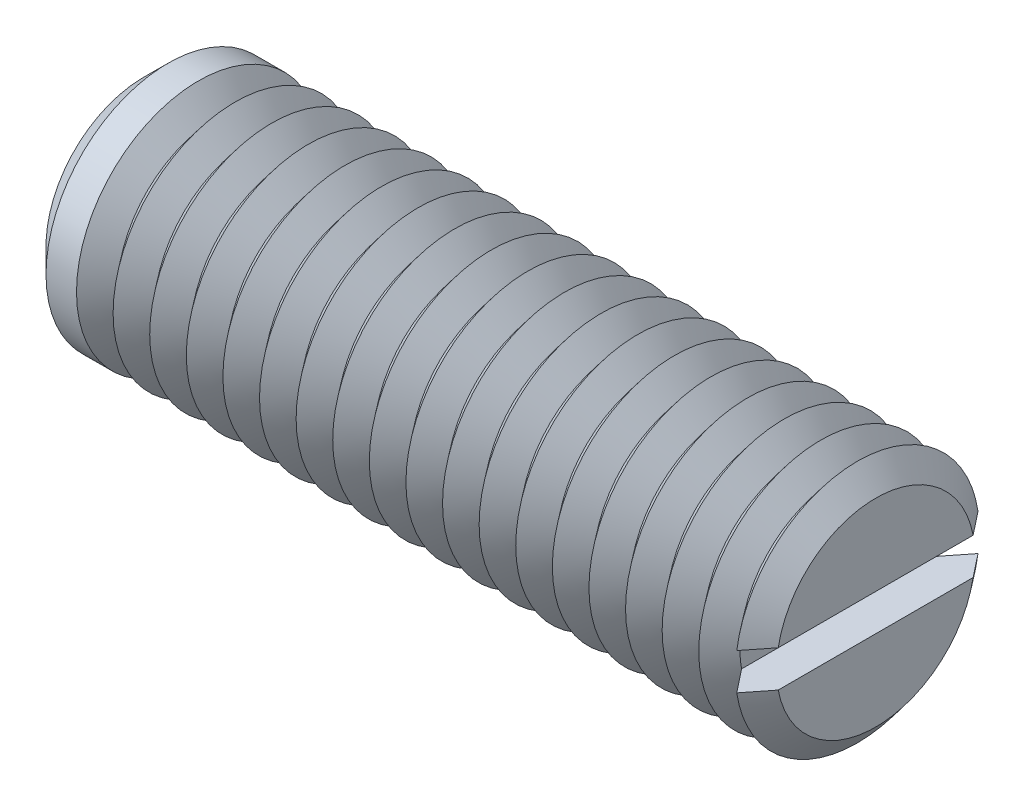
ISO-10303-21;
HEADER;
FILE_DESCRIPTION(('STEP AP214'),'2;1');
FILE_NAME('part.step','',(''),(''),'','','');
FILE_SCHEMA(('AUTOMOTIVE_DESIGN { 1 0 10303 214 1 1 1 1 }'));
ENDSEC;
DATA;
#1=APPLICATION_CONTEXT('core data for automotive mechanical design processes');
#2=APPLICATION_PROTOCOL_DEFINITION('international standard','automotive_design',2000,#1);
#3=PRODUCT_CONTEXT('',#1,'mechanical');
#4=PRODUCT('Part','Part','',(#3));
#5=PRODUCT_RELATED_PRODUCT_CATEGORY('part','',(#4));
#6=PRODUCT_DEFINITION_FORMATION('','',#4);
#7=PRODUCT_DEFINITION_CONTEXT('part definition',#1,'design');
#8=PRODUCT_DEFINITION('design','',#6,#7);
#9=PRODUCT_DEFINITION_SHAPE('','',#8);
#10=(LENGTH_UNIT() NAMED_UNIT(*) SI_UNIT(.MILLI.,.METRE.));
#11=(NAMED_UNIT(*) PLANE_ANGLE_UNIT() SI_UNIT($,.RADIAN.));
#12=(NAMED_UNIT(*) SI_UNIT($,.STERADIAN.) SOLID_ANGLE_UNIT());
#13=UNCERTAINTY_MEASURE_WITH_UNIT(LENGTH_MEASURE(1.E-05),#10,'distance_accuracy_value','');
#14=(GEOMETRIC_REPRESENTATION_CONTEXT(3) GLOBAL_UNCERTAINTY_ASSIGNED_CONTEXT((#13)) GLOBAL_UNIT_ASSIGNED_CONTEXT((#10,
#11,#12)) REPRESENTATION_CONTEXT('',''));
#15=CARTESIAN_POINT('',(0.,0.,0.));
#16=DIRECTION('',(0.,0.,1.));
#17=DIRECTION('',(1.,0.,0.));
#18=AXIS2_PLACEMENT_3D('',#15,#16,#17);
#19=CARTESIAN_POINT('',(14.25,0.,0.));
#20=DIRECTION('',(1.,0.,0.));
#21=DIRECTION('',(0.,0.,-1.));
#22=AXIS2_PLACEMENT_3D('',#19,#20,#21);
#23=CONICAL_SURFACE('',#22,5.,0.895664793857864);
#24=CARTESIAN_POINT('',(14.25,0.,0.));
#25=DIRECTION('',(-1.,0.,0.));
#26=DIRECTION('',(0.,0.,1.));
#27=AXIS2_PLACEMENT_3D('',#24,#25,#26);
#28=CIRCLE('',#27,5.);
#29=CARTESIAN_POINT('',(14.25,-0.75,-4.9434299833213));
#30=VERTEX_POINT('',#29);
#31=CARTESIAN_POINT('',(14.25,-0.75,4.9434299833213));
#32=VERTEX_POINT('',#31);
#33=EDGE_CURVE('E117',#30,#32,#28,.T.);
#34=ORIENTED_EDGE('',*,*,#33,.T.);
#35=CARTESIAN_POINT('',(18.9886555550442,-0.75,-10.8927895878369));
#36=CARTESIAN_POINT('',(18.678663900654,-0.75,-10.5046848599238));
#37=CARTESIAN_POINT('',(18.3687121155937,-0.75,-10.1165482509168));
#38=CARTESIAN_POINT('',(17.7489116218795,-0.75,-9.34012563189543));
#39=CARTESIAN_POINT('',(17.4390629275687,-0.75,-8.95183961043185));
#40=CARTESIAN_POINT('',(16.8189382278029,-0.75,-8.17433811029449));
#41=CARTESIAN_POINT('',(16.5086626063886,-0.75,-7.78512232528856));
#42=CARTESIAN_POINT('',(15.8884400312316,-0.75,-7.00649525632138));
#43=CARTESIAN_POINT('',(15.5784930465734,-0.75,-6.6170839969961));
#44=CARTESIAN_POINT('',(15.1053943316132,-0.75,-6.02191131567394));
#45=CARTESIAN_POINT('',(14.9420627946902,-0.75,-5.81629283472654));
#46=CARTESIAN_POINT('',(14.6155893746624,-0.75,-5.40490151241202));
#47=CARTESIAN_POINT('',(14.4524474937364,-0.75,-5.19912866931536));
#48=CARTESIAN_POINT('',(14.1263799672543,-0.75,-4.7873022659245));
#49=CARTESIAN_POINT('',(13.9634544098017,-0.75,-4.58124863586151));
#50=CARTESIAN_POINT('',(13.638006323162,-0.75,-4.16883695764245));
#51=CARTESIAN_POINT('',(13.4754837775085,-0.75,-3.96247892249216));
#52=CARTESIAN_POINT('',(13.1512888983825,-0.75,-3.54956515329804));
#53=CARTESIAN_POINT('',(12.9896156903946,-0.75,-3.34301010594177));
#54=CARTESIAN_POINT('',(12.6672688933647,-0.75,-2.92906737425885));
#55=CARTESIAN_POINT('',(12.5065954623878,-0.75,-2.72167956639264));
#56=CARTESIAN_POINT('',(12.2671162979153,-0.75,-2.40952296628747));
#57=CARTESIAN_POINT('',(12.187569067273,-0.75,-2.30532351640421));
#58=CARTESIAN_POINT('',(12.0292089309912,-0.75,-2.09636868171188));
#59=CARTESIAN_POINT('',(11.9503960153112,-0.75,-1.99161330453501));
#60=CARTESIAN_POINT('',(11.7939159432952,-0.75,-1.78128982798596));
#61=CARTESIAN_POINT('',(11.7162485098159,-0.75,-1.67572193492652));
#62=CARTESIAN_POINT('',(11.5627483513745,-0.75,-1.46326300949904));
#63=CARTESIAN_POINT('',(11.4869154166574,-0.75,-1.35637213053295));
#64=CARTESIAN_POINT('',(11.3961291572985,-0.75,-1.22407390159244));
#65=CARTESIAN_POINT('',(11.3795740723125,-0.75,-1.19976686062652));
#66=CARTESIAN_POINT('',(11.3466682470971,-0.75,-1.15101442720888));
#67=CARTESIAN_POINT('',(11.3303175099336,-0.75,-1.12656903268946));
#68=CARTESIAN_POINT('',(11.2816161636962,-0.75,-1.05299302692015));
#69=CARTESIAN_POINT('',(11.2496192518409,-0.75,-1.00362669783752));
#70=CARTESIAN_POINT('',(11.1868890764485,-0.75,-0.903957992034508));
#71=CARTESIAN_POINT('',(11.1561584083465,-0.75,-0.853653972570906));
#72=CARTESIAN_POINT('',(11.0966309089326,-0.75,-0.751913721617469));
#73=CARTESIAN_POINT('',(11.0678337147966,-0.75,-0.700477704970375));
#74=CARTESIAN_POINT('',(11.0225435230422,-0.75,-0.613963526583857));
#75=CARTESIAN_POINT('',(11.0052186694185,-0.75,-0.579327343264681));
#76=CARTESIAN_POINT('',(10.9722687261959,-0.75,-0.509265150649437));
#77=CARTESIAN_POINT('',(10.9566439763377,-0.75,-0.473838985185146));
#78=CARTESIAN_POINT('',(10.9132659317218,-0.75,-0.366382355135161));
#79=CARTESIAN_POINT('',(10.8888237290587,-0.75,-0.292842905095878));
#80=CARTESIAN_POINT('',(10.8658405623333,-0.75,-0.189809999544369));
#81=CARTESIAN_POINT('',(10.8606856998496,-0.75,-0.161782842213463));
#82=CARTESIAN_POINT('',(10.8527704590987,-0.75,-0.105398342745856));
#83=CARTESIAN_POINT('',(10.8500088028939,-0.75,-0.0770411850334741));
#84=CARTESIAN_POINT('',(10.8470684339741,-0.75,-0.0202548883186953));
#85=CARTESIAN_POINT('',(10.8468839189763,-0.75,0.00817394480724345));
#86=CARTESIAN_POINT('',(10.8490950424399,-0.75,0.064932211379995));
#87=CARTESIAN_POINT('',(10.851491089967,-0.75,0.0932616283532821));
#88=CARTESIAN_POINT('',(10.8596937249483,-0.75,0.157351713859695));
#89=CARTESIAN_POINT('',(10.8662565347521,-0.75,0.193015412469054));
#90=CARTESIAN_POINT('',(10.8827020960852,-0.75,0.263573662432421));
#91=CARTESIAN_POINT('',(10.8925874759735,-0.75,0.298467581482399));
#92=CARTESIAN_POINT('',(10.9150598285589,-0.75,0.367652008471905));
#93=CARTESIAN_POINT('',(10.9276667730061,-0.75,0.401935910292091));
#94=CARTESIAN_POINT('',(10.9549130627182,-0.75,0.469664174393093));
#95=CARTESIAN_POINT('',(10.9695519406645,-0.75,0.503108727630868));
#96=CARTESIAN_POINT('',(11.0166350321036,-0.75,0.604259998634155));
#97=CARTESIAN_POINT('',(11.051542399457,-0.75,0.670810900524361));
#98=CARTESIAN_POINT('',(11.1250588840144,-0.75,0.801849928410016));
#99=CARTESIAN_POINT('',(11.1636717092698,-0.75,0.866335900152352));
#100=CARTESIAN_POINT('',(11.2432739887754,-0.75,0.994050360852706));
#101=CARTESIAN_POINT('',(11.284269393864,-0.75,1.057275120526));
#102=CARTESIAN_POINT('',(11.3677403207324,-0.75,1.18274150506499));
#103=CARTESIAN_POINT('',(11.4102160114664,-0.75,1.24498301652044));
#104=CARTESIAN_POINT('',(11.4963066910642,-0.75,1.36895722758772));
#105=CARTESIAN_POINT('',(11.5399248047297,-0.75,1.43068775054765));
#106=CARTESIAN_POINT('',(11.6278819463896,-0.75,1.55364126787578));
#107=CARTESIAN_POINT('',(11.672221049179,-0.75,1.61486420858));
#108=CARTESIAN_POINT('',(11.7613408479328,-0.75,1.73681254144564));
#109=CARTESIAN_POINT('',(11.8061205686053,-0.75,1.79753864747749));
#110=CARTESIAN_POINT('',(11.8960732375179,-0.75,1.91869503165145));
#111=CARTESIAN_POINT('',(11.9412461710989,-0.75,1.9791253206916));
#112=CARTESIAN_POINT('',(12.0761092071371,-0.75,2.15860363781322));
#113=CARTESIAN_POINT('',(12.1662359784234,-0.75,2.27732336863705));
#114=CARTESIAN_POINT('',(12.3472315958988,-0.75,2.5141961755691));
#115=CARTESIAN_POINT('',(12.4381004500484,-0.75,2.63234924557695));
#116=CARTESIAN_POINT('',(12.7114512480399,-0.75,2.98624879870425));
#117=CARTESIAN_POINT('',(12.8946699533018,-0.75,3.22142577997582));
#118=CARTESIAN_POINT('',(13.262238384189,-0.75,3.69117947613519));
#119=CARTESIAN_POINT('',(13.4465888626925,-0.75,3.92575559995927));
#120=CARTESIAN_POINT('',(13.81587911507,-0.75,4.39443534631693));
#121=CARTESIAN_POINT('',(14.000818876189,-0.75,4.62853897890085));
#122=CARTESIAN_POINT('',(14.370331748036,-0.75,5.09551589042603));
#123=CARTESIAN_POINT('',(14.5549033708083,-0.75,5.32839034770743));
#124=CARTESIAN_POINT('',(14.9242990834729,-0.75,5.79394105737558));
#125=CARTESIAN_POINT('',(15.1091231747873,-0.75,6.02661730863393));
#126=CARTESIAN_POINT('',(15.6637745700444,-0.75,6.72433690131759));
#127=CARTESIAN_POINT('',(16.0338620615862,-0.75,7.18917337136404));
#128=CARTESIAN_POINT('',(16.6190458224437,-0.75,7.92356230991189));
#129=CARTESIAN_POINT('',(16.8340169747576,-0.75,8.19321453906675));
#130=CARTESIAN_POINT('',(17.2640698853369,-0.75,8.73245662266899));
#131=CARTESIAN_POINT('',(17.479151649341,-0.75,9.00204647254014));
#132=CARTESIAN_POINT('',(17.9099436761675,-0.75,9.54186292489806));
#133=CARTESIAN_POINT('',(18.1256541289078,-0.75,9.81208937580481));
#134=CARTESIAN_POINT('',(18.5571210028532,-0.75,10.3524795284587));
#135=CARTESIAN_POINT('',(18.7728774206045,-0.75,10.6226432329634));
#136=CARTESIAN_POINT('',(18.9886555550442,-0.75,10.8927895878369));
#137=B_SPLINE_CURVE_WITH_KNOTS('',3,(#35,#36,#37,#38,#39,#40,#41,#42,#43,#44,#45,#46,#47,#48,
#49,#50,#51,#52,#53,#54,#55,#56,#57,#58,#59,#60,#61,#62,#63,#64,#65,#66,#67,#68,#69,#70,#71,#72,
#73,#74,#75,#76,#77,#78,#79,#80,#81,#82,#83,#84,#85,#86,#87,#88,#89,#90,#91,#92,#93,#94,#95,#96,
#97,#98,#99,#100,#101,#102,#103,#104,#105,#106,#107,#108,#109,#110,#111,#112,#113,#114,#115,
#116,#117,#118,#119,#120,#121,#122,#123,#124,#125,#126,#127,#128,#129,#130,#131,#132,#133,#134,
#135,#136),.UNSPECIFIED.,.F.,.F.,(4,2,2,2,2,2,2,2,2,2,2,2,2,2,2,2,2,2,2,2,2,2,2,2,2,2,2,2,2,2,2,
2,2,2,2,2,2,2,2,2,2,2,2,2,2,2,2,2,2,2,4),(0.,1.49012787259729,2.98041311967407,4.4736775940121,
5.96678625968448,6.75457128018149,7.54236526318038,8.33041673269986,9.11843545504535,
9.90534542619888,10.6923767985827,11.0856530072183,11.4789238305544,11.8720978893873,
12.265226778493,12.3534535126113,12.441681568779,12.6181526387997,12.7949690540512,
12.9717521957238,13.0878863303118,13.2040436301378,13.43522465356,13.5206311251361,
13.605991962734,13.6911605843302,13.7763427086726,13.8849305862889,13.9936045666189,
14.1031049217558,14.2125801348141,14.4377857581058,14.6632191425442,14.8892420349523,
15.1152908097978,15.3420406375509,15.5688141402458,15.7951656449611,16.0215087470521,
16.4686664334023,16.91582892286,17.8101909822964,18.7052318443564,19.6002534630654,
20.4916985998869,21.3831487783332,23.1656575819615,24.2002223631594,25.2348477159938,
26.2721422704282,27.3093757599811),.UNSPECIFIED.);
#138=CARTESIAN_POINT('',(13.5,-0.75,3.99343248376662));
#139=VERTEX_POINT('',#138);
#140=EDGE_CURVE('E109',#139,#32,#137,.T.);
#141=ORIENTED_EDGE('',*,*,#140,.F.);
#142=CARTESIAN_POINT('',(13.5,0.,0.));
#143=DIRECTION('',(-1.,0.,0.));
#144=DIRECTION('',(0.,0.,1.));
#145=AXIS2_PLACEMENT_3D('',#142,#143,#144);
#146=CIRCLE('',#145,4.06325030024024);
#147=CARTESIAN_POINT('',(13.5,-0.75,-3.99343248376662));
#148=VERTEX_POINT('',#147);
#149=EDGE_CURVE('E367',#148,#139,#146,.T.);
#150=ORIENTED_EDGE('',*,*,#149,.F.);
#151=EDGE_CURVE('E58',#30,#148,#137,.T.);
#152=ORIENTED_EDGE('',*,*,#151,.F.);
#153=EDGE_LOOP('',(#34,#141,#150,#152));
#154=FACE_BOUND('',#153,.T.);
#155=ADVANCED_FACE('F37',(#154),#23,.T.);
#156=CARTESIAN_POINT('',(14.25,0.75,4.9434299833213));
#157=VERTEX_POINT('',#156);
#158=CARTESIAN_POINT('',(14.25,0.75,-4.9434299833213));
#159=VERTEX_POINT('',#158);
#160=EDGE_CURVE('E100',#157,#159,#28,.T.);
#161=ORIENTED_EDGE('',*,*,#160,.T.);
#162=CARTESIAN_POINT('',(18.9886555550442,0.75,10.8927895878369));
#163=CARTESIAN_POINT('',(18.678663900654,0.75,10.5046848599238));
#164=CARTESIAN_POINT('',(18.3687121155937,0.75,10.1165482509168));
#165=CARTESIAN_POINT('',(17.7489116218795,0.75,9.34012563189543));
#166=CARTESIAN_POINT('',(17.4390629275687,0.75,8.95183961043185));
#167=CARTESIAN_POINT('',(16.8189382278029,0.75,8.1743381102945));
#168=CARTESIAN_POINT('',(16.5086626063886,0.75,7.78512232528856));
#169=CARTESIAN_POINT('',(15.8884400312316,0.75,7.00649525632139));
#170=CARTESIAN_POINT('',(15.5784930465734,0.75,6.6170839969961));
#171=CARTESIAN_POINT('',(15.1053943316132,0.75,6.02191131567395));
#172=CARTESIAN_POINT('',(14.9420627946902,0.75,5.81629283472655));
#173=CARTESIAN_POINT('',(14.6155893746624,0.75,5.40490151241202));
#174=CARTESIAN_POINT('',(14.4524474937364,0.75,5.19912866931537));
#175=CARTESIAN_POINT('',(14.1263799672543,0.75,4.78730226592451));
#176=CARTESIAN_POINT('',(13.9634544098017,0.75,4.58124863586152));
#177=CARTESIAN_POINT('',(13.638006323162,0.75,4.16883695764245));
#178=CARTESIAN_POINT('',(13.4754837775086,0.75,3.96247892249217));
#179=CARTESIAN_POINT('',(13.1512888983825,0.75,3.54956515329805));
#180=CARTESIAN_POINT('',(12.9896156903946,0.75,3.34301010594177));
#181=CARTESIAN_POINT('',(12.6672688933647,0.75,2.92906737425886));
#182=CARTESIAN_POINT('',(12.5065954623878,0.75,2.72167956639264));
#183=CARTESIAN_POINT('',(12.2671162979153,0.75,2.40952296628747));
#184=CARTESIAN_POINT('',(12.187569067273,0.75,2.30532351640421));
#185=CARTESIAN_POINT('',(12.0292089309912,0.75,2.09636868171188));
#186=CARTESIAN_POINT('',(11.9503960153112,0.75,1.99161330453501));
#187=CARTESIAN_POINT('',(11.7939159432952,0.75,1.78128982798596));
#188=CARTESIAN_POINT('',(11.7162485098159,0.75,1.67572193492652));
#189=CARTESIAN_POINT('',(11.5627483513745,0.75,1.46326300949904));
#190=CARTESIAN_POINT('',(11.4869154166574,0.75,1.35637213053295));
#191=CARTESIAN_POINT('',(11.3961291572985,0.75,1.22407390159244));
#192=CARTESIAN_POINT('',(11.3795740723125,0.75,1.19976686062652));
#193=CARTESIAN_POINT('',(11.3466682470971,0.75,1.15101442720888));
#194=CARTESIAN_POINT('',(11.3303175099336,0.75,1.12656903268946));
#195=CARTESIAN_POINT('',(11.2816161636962,0.75,1.05299302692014));
#196=CARTESIAN_POINT('',(11.2496192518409,0.75,1.00362669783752));
#197=CARTESIAN_POINT('',(11.1868890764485,0.75,0.903957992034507));
#198=CARTESIAN_POINT('',(11.1561584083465,0.75,0.853653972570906));
#199=CARTESIAN_POINT('',(11.0966309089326,0.75,0.751913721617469));
#200=CARTESIAN_POINT('',(11.0678337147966,0.75,0.700477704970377));
#201=CARTESIAN_POINT('',(11.0225435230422,0.75,0.613963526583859));
#202=CARTESIAN_POINT('',(11.0052186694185,0.75,0.579327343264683));
#203=CARTESIAN_POINT('',(10.9722687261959,0.75,0.509265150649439));
#204=CARTESIAN_POINT('',(10.9566439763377,0.75,0.473838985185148));
#205=CARTESIAN_POINT('',(10.9132659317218,0.75,0.366382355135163));
#206=CARTESIAN_POINT('',(10.8888237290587,0.75,0.292842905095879));
#207=CARTESIAN_POINT('',(10.8658405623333,0.75,0.189809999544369));
#208=CARTESIAN_POINT('',(10.8606856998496,0.75,0.161782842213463));
#209=CARTESIAN_POINT('',(10.8527704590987,0.75,0.105398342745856));
#210=CARTESIAN_POINT('',(10.8500088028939,0.75,0.0770411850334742));
#211=CARTESIAN_POINT('',(10.8470684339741,0.75,0.0202548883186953));
#212=CARTESIAN_POINT('',(10.8468839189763,0.75,-0.00817394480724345));
#213=CARTESIAN_POINT('',(10.8490950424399,0.75,-0.064932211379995));
#214=CARTESIAN_POINT('',(10.851491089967,0.75,-0.0932616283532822));
#215=CARTESIAN_POINT('',(10.8596937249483,0.75,-0.157351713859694));
#216=CARTESIAN_POINT('',(10.8662565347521,0.75,-0.193015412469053));
#217=CARTESIAN_POINT('',(10.8827020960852,0.75,-0.26357366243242));
#218=CARTESIAN_POINT('',(10.8925874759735,0.75,-0.298467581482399));
#219=CARTESIAN_POINT('',(10.9150598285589,0.75,-0.367652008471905));
#220=CARTESIAN_POINT('',(10.9276667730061,0.75,-0.401935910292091));
#221=CARTESIAN_POINT('',(10.9549130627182,0.75,-0.469664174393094));
#222=CARTESIAN_POINT('',(10.9695519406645,0.75,-0.503108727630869));
#223=CARTESIAN_POINT('',(11.0166350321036,0.75,-0.604259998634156));
#224=CARTESIAN_POINT('',(11.051542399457,0.75,-0.670810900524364));
#225=CARTESIAN_POINT('',(11.1250588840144,0.75,-0.801849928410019));
#226=CARTESIAN_POINT('',(11.1636717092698,0.75,-0.866335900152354));
#227=CARTESIAN_POINT('',(11.2432739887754,0.75,-0.994050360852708));
#228=CARTESIAN_POINT('',(11.284269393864,0.75,-1.057275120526));
#229=CARTESIAN_POINT('',(11.3677403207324,0.75,-1.182741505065));
#230=CARTESIAN_POINT('',(11.4102160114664,0.75,-1.24498301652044));
#231=CARTESIAN_POINT('',(11.4963066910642,0.75,-1.36895722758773));
#232=CARTESIAN_POINT('',(11.5399248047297,0.75,-1.43068775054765));
#233=CARTESIAN_POINT('',(11.6278819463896,0.75,-1.55364126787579));
#234=CARTESIAN_POINT('',(11.672221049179,0.75,-1.61486420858));
#235=CARTESIAN_POINT('',(11.7613408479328,0.75,-1.73681254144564));
#236=CARTESIAN_POINT('',(11.8061205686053,0.75,-1.79753864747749));
#237=CARTESIAN_POINT('',(11.8960732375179,0.75,-1.91869503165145));
#238=CARTESIAN_POINT('',(11.9412461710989,0.75,-1.97912532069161));
#239=CARTESIAN_POINT('',(12.0761092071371,0.75,-2.15860363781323));
#240=CARTESIAN_POINT('',(12.1662359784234,0.75,-2.27732336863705));
#241=CARTESIAN_POINT('',(12.3472315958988,0.75,-2.51419617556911));
#242=CARTESIAN_POINT('',(12.4381004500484,0.75,-2.63234924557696));
#243=CARTESIAN_POINT('',(12.7114512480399,0.75,-2.98624879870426));
#244=CARTESIAN_POINT('',(12.8946699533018,0.75,-3.22142577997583));
#245=CARTESIAN_POINT('',(13.262238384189,0.75,-3.6911794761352));
#246=CARTESIAN_POINT('',(13.4465888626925,0.75,-3.92575559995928));
#247=CARTESIAN_POINT('',(13.81587911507,0.75,-4.39443534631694));
#248=CARTESIAN_POINT('',(14.0008188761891,0.75,-4.62853897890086));
#249=CARTESIAN_POINT('',(14.370331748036,0.75,-5.09551589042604));
#250=CARTESIAN_POINT('',(14.5549033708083,0.75,-5.32839034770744));
#251=CARTESIAN_POINT('',(14.9242990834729,0.75,-5.79394105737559));
#252=CARTESIAN_POINT('',(15.1091231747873,0.75,-6.02661730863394));
#253=CARTESIAN_POINT('',(15.6637745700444,0.75,-6.7243369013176));
#254=CARTESIAN_POINT('',(16.0338620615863,0.75,-7.18917337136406));
#255=CARTESIAN_POINT('',(16.6190458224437,0.75,-7.9235623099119));
#256=CARTESIAN_POINT('',(16.8340169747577,0.75,-8.19321453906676));
#257=CARTESIAN_POINT('',(17.2640698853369,0.75,-8.732456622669));
#258=CARTESIAN_POINT('',(17.479151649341,0.75,-9.00204647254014));
#259=CARTESIAN_POINT('',(17.9099436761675,0.75,-9.54186292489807));
#260=CARTESIAN_POINT('',(18.1256541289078,0.75,-9.81208937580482));
#261=CARTESIAN_POINT('',(18.5571210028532,0.75,-10.3524795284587));
#262=CARTESIAN_POINT('',(18.7728774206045,0.75,-10.6226432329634));
#263=CARTESIAN_POINT('',(18.9886555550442,0.75,-10.8927895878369));
#264=B_SPLINE_CURVE_WITH_KNOTS('',3,(#162,#163,#164,#165,#166,#167,#168,#169,#170,#171,#172,
#173,#174,#175,#176,#177,#178,#179,#180,#181,#182,#183,#184,#185,#186,#187,#188,#189,#190,#191,
#192,#193,#194,#195,#196,#197,#198,#199,#200,#201,#202,#203,#204,#205,#206,#207,#208,#209,#210,
#211,#212,#213,#214,#215,#216,#217,#218,#219,#220,#221,#222,#223,#224,#225,#226,#227,#228,#229,
#230,#231,#232,#233,#234,#235,#236,#237,#238,#239,#240,#241,#242,#243,#244,#245,#246,#247,#248,
#249,#250,#251,#252,#253,#254,#255,#256,#257,#258,#259,#260,#261,#262,#263),.UNSPECIFIED.,.F.,
.F.,(4,2,2,2,2,2,2,2,2,2,2,2,2,2,2,2,2,2,2,2,2,2,2,2,2,2,2,2,2,2,2,2,2,2,2,2,2,2,2,2,2,2,2,2,2,
2,2,2,2,2,4),(0.,1.49012787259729,2.98041311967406,4.47367759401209,5.96678625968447,
6.75457128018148,7.54236526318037,8.33041673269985,9.11843545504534,9.90534542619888,
10.6923767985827,11.0856530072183,11.4789238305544,11.8720978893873,12.265226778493,
12.3534535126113,12.441681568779,12.6181526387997,12.7949690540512,12.9717521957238,
13.0878863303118,13.2040436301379,13.43522465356,13.5206311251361,13.6059919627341,
13.6911605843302,13.7763427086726,13.8849305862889,13.9936045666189,14.1031049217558,
14.2125801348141,14.4377857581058,14.6632191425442,14.8892420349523,15.1152908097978,
15.3420406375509,15.5688141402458,15.7951656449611,16.0215087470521,16.4686664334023,
16.91582892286,17.8101909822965,18.7052318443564,19.6002534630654,20.4916985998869,
21.3831487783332,23.1656575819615,24.2002223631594,25.2348477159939,26.2721422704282,
27.3093757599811),.UNSPECIFIED.);
#265=CARTESIAN_POINT('',(13.5,0.75,-3.99343248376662));
#266=VERTEX_POINT('',#265);
#267=EDGE_CURVE('E110',#266,#159,#264,.T.);
#268=ORIENTED_EDGE('',*,*,#267,.F.);
#269=CARTESIAN_POINT('',(13.5,0.75,3.99343248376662));
#270=VERTEX_POINT('',#269);
#271=EDGE_CURVE('E103',#270,#266,#146,.T.);
#272=ORIENTED_EDGE('',*,*,#271,.F.);
#273=EDGE_CURVE('E97',#157,#270,#264,.T.);
#274=ORIENTED_EDGE('',*,*,#273,.F.);
#275=EDGE_LOOP('',(#161,#268,#272,#274));
#276=FACE_BOUND('',#275,.T.);
#277=ADVANCED_FACE('F99',(#276),#23,.T.);
#278=CARTESIAN_POINT('',(13.5,0.,0.));
#279=DIRECTION('',(-1.,0.,0.));
#280=DIRECTION('',(0.,0.,1.));
#281=AXIS2_PLACEMENT_3D('',#278,#279,#280);
#282=CONICAL_SURFACE('',#281,4.06325030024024,0.895664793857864);
#283=CARTESIAN_POINT('',(12.75,0.,0.));
#284=DIRECTION('',(-1.,0.,0.));
#285=DIRECTION('',(0.,0.,1.));
#286=AXIS2_PLACEMENT_3D('',#283,#284,#285);
#287=CIRCLE('',#286,5.);
#288=CARTESIAN_POINT('',(12.75,0.,5.));
#289=VERTEX_POINT('',#288);
#290=EDGE_CURVE('E354',#289,#289,#287,.T.);
#291=ORIENTED_EDGE('',*,*,#290,.F.);
#292=EDGE_LOOP('',(#291));
#293=FACE_BOUND('',#292,.T.);
#294=ORIENTED_EDGE('',*,*,#271,.T.);
#295=EDGE_CURVE('E361',#266,#148,#146,.T.);
#296=ORIENTED_EDGE('',*,*,#295,.T.);
#297=ORIENTED_EDGE('',*,*,#149,.T.);
#298=EDGE_CURVE('E360',#139,#270,#146,.T.);
#299=ORIENTED_EDGE('',*,*,#298,.T.);
#300=EDGE_LOOP('',(#294,#296,#297,#299));
#301=FACE_BOUND('',#300,.T.);
#302=ADVANCED_FACE('F167',(#293,#301),#282,.T.);
#303=CARTESIAN_POINT('',(15.,0.,0.));
#304=DIRECTION('',(1.,0.,0.));
#305=DIRECTION('',(0.,0.,-1.));
#306=AXIS2_PLACEMENT_3D('',#303,#304,#305);
#307=PLANE('',#306);
#308=CARTESIAN_POINT('',(15.,0.,0.));
#309=DIRECTION('',(-1.,0.,0.));
#310=DIRECTION('',(0.,0.,1.));
#311=AXIS2_PLACEMENT_3D('',#308,#309,#310);
#312=CIRCLE('',#311,4.06325030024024);
#313=CARTESIAN_POINT('',(15.,0.75,3.99343248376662));
#314=VERTEX_POINT('',#313);
#315=CARTESIAN_POINT('',(15.,0.75,-3.99343248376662));
#316=VERTEX_POINT('',#315);
#317=EDGE_CURVE('E159',#314,#316,#312,.T.);
#318=ORIENTED_EDGE('',*,*,#317,.F.);
#319=DIRECTION('',(0.,0.,1.));
#320=VECTOR('',#319,1.);
#321=CARTESIAN_POINT('',(15.,0.75,0.));
#322=LINE('',#321,#320);
#323=EDGE_CURVE('E122',#316,#314,#322,.T.);
#324=ORIENTED_EDGE('',*,*,#323,.F.);
#325=EDGE_LOOP('',(#318,#324));
#326=FACE_BOUND('',#325,.T.);
#327=ADVANCED_FACE('F171',(#326),#307,.T.);
#328=CARTESIAN_POINT('',(15.,-0.75,-3.99343248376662));
#329=VERTEX_POINT('',#328);
#330=CARTESIAN_POINT('',(15.,-0.75,3.99343248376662));
#331=VERTEX_POINT('',#330);
#332=EDGE_CURVE('E66',#329,#331,#312,.T.);
#333=ORIENTED_EDGE('',*,*,#332,.F.);
#334=DIRECTION('',(0.,0.,-1.));
#335=VECTOR('',#334,1.);
#336=CARTESIAN_POINT('',(15.,-0.75,0.));
#337=LINE('',#336,#335);
#338=EDGE_CURVE('E135',#331,#329,#337,.T.);
#339=ORIENTED_EDGE('',*,*,#338,.F.);
#340=EDGE_LOOP('',(#333,#339));
#341=FACE_BOUND('',#340,.T.);
#342=ADVANCED_FACE('F200',(#341),#307,.T.);
#343=CARTESIAN_POINT('',(15.,0.,0.));
#344=DIRECTION('',(-1.,0.,0.));
#345=DIRECTION('',(0.,0.,1.));
#346=AXIS2_PLACEMENT_3D('',#343,#344,#345);
#347=CONICAL_SURFACE('',#346,4.06325030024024,0.895664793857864);
#348=ORIENTED_EDGE('',*,*,#160,.F.);
#349=CARTESIAN_POINT('',(9.51134444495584,0.75,-10.8927895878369));
#350=CARTESIAN_POINT('',(9.82133609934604,0.75,-10.5046848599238));
#351=CARTESIAN_POINT('',(10.1312878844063,0.75,-10.1165482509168));
#352=CARTESIAN_POINT('',(10.7510883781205,0.75,-9.34012563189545));
#353=CARTESIAN_POINT('',(11.0609370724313,0.75,-8.95183961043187));
#354=CARTESIAN_POINT('',(11.6810617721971,0.75,-8.17433811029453));
#355=CARTESIAN_POINT('',(11.9913373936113,0.75,-7.7851223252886));
#356=CARTESIAN_POINT('',(12.6115599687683,0.75,-7.00649525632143));
#357=CARTESIAN_POINT('',(12.9215069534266,0.75,-6.61708399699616));
#358=CARTESIAN_POINT('',(13.3946056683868,0.75,-6.021911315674));
#359=CARTESIAN_POINT('',(13.5579372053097,0.75,-5.8162928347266));
#360=CARTESIAN_POINT('',(13.8844106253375,0.75,-5.40490151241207));
#361=CARTESIAN_POINT('',(14.0475525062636,0.75,-5.19912866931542));
#362=CARTESIAN_POINT('',(14.3736200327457,0.75,-4.78730226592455));
#363=CARTESIAN_POINT('',(14.5365455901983,0.75,-4.58124863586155));
#364=CARTESIAN_POINT('',(14.861993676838,0.75,-4.16883695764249));
#365=CARTESIAN_POINT('',(15.0245162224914,0.75,-3.9624789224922));
#366=CARTESIAN_POINT('',(15.3487111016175,0.75,-3.54956515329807));
#367=CARTESIAN_POINT('',(15.5103843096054,0.75,-3.3430101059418));
#368=CARTESIAN_POINT('',(15.8327311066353,0.75,-2.92906737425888));
#369=CARTESIAN_POINT('',(15.9934045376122,0.75,-2.72167956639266));
#370=CARTESIAN_POINT('',(16.2328837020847,0.75,-2.40952296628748));
#371=CARTESIAN_POINT('',(16.312430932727,0.75,-2.30532351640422));
#372=CARTESIAN_POINT('',(16.4707910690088,0.75,-2.09636868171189));
#373=CARTESIAN_POINT('',(16.5496039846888,0.75,-1.99161330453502));
#374=CARTESIAN_POINT('',(16.7060840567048,0.75,-1.78128982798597));
#375=CARTESIAN_POINT('',(16.7837514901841,0.75,-1.67572193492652));
#376=CARTESIAN_POINT('',(16.9372516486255,0.75,-1.46326300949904));
#377=CARTESIAN_POINT('',(17.0130845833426,0.75,-1.35637213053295));
#378=CARTESIAN_POINT('',(17.1038708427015,0.75,-1.22407390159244));
#379=CARTESIAN_POINT('',(17.1204259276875,0.75,-1.19976686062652));
#380=CARTESIAN_POINT('',(17.1533317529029,0.75,-1.15101442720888));
#381=CARTESIAN_POINT('',(17.1696824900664,0.75,-1.12656903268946));
#382=CARTESIAN_POINT('',(17.2183838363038,0.75,-1.05299302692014));
#383=CARTESIAN_POINT('',(17.2503807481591,0.75,-1.00362669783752));
#384=CARTESIAN_POINT('',(17.3131109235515,0.75,-0.903957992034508));
#385=CARTESIAN_POINT('',(17.3438415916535,0.75,-0.853653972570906));
#386=CARTESIAN_POINT('',(17.4033690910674,0.75,-0.751913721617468));
#387=CARTESIAN_POINT('',(17.4321662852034,0.75,-0.700477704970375));
#388=CARTESIAN_POINT('',(17.4774564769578,0.75,-0.613963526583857));
#389=CARTESIAN_POINT('',(17.4947813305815,0.75,-0.579327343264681));
#390=CARTESIAN_POINT('',(17.5277312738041,0.75,-0.509265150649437));
#391=CARTESIAN_POINT('',(17.5433560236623,0.75,-0.473838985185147));
#392=CARTESIAN_POINT('',(17.5867340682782,0.75,-0.366382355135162));
#393=CARTESIAN_POINT('',(17.6111762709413,0.75,-0.292842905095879));
#394=CARTESIAN_POINT('',(17.6341594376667,0.75,-0.18980999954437));
#395=CARTESIAN_POINT('',(17.6393143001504,0.75,-0.161782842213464));
#396=CARTESIAN_POINT('',(17.6472295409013,0.75,-0.105398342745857));
#397=CARTESIAN_POINT('',(17.6499911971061,0.75,-0.0770411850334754));
#398=CARTESIAN_POINT('',(17.6529315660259,0.75,-0.0202548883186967));
#399=CARTESIAN_POINT('',(17.6531160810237,0.75,0.00817394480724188));
#400=CARTESIAN_POINT('',(17.6509049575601,0.75,0.0649322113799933));
#401=CARTESIAN_POINT('',(17.648508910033,0.75,0.0932616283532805));
#402=CARTESIAN_POINT('',(17.6403062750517,0.75,0.157351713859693));
#403=CARTESIAN_POINT('',(17.6337434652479,0.75,0.193015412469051));
#404=CARTESIAN_POINT('',(17.6172979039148,0.75,0.263573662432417));
#405=CARTESIAN_POINT('',(17.6074125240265,0.75,0.298467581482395));
#406=CARTESIAN_POINT('',(17.5849401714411,0.75,0.367652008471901));
#407=CARTESIAN_POINT('',(17.5723332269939,0.75,0.401935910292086));
#408=CARTESIAN_POINT('',(17.5450869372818,0.75,0.469664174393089));
#409=CARTESIAN_POINT('',(17.5304480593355,0.75,0.503108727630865));
#410=CARTESIAN_POINT('',(17.4833649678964,0.75,0.604259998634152));
#411=CARTESIAN_POINT('',(17.448457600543,0.75,0.670810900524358));
#412=CARTESIAN_POINT('',(17.3749411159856,0.75,0.801849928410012));
#413=CARTESIAN_POINT('',(17.3363282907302,0.75,0.866335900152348));
#414=CARTESIAN_POINT('',(17.2567260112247,0.75,0.994050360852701));
#415=CARTESIAN_POINT('',(17.215730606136,0.75,1.05727512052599));
#416=CARTESIAN_POINT('',(17.1322596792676,0.75,1.18274150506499));
#417=CARTESIAN_POINT('',(17.0897839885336,0.75,1.24498301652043));
#418=CARTESIAN_POINT('',(17.0036933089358,0.75,1.36895722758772));
#419=CARTESIAN_POINT('',(16.9600751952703,0.75,1.43068775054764));
#420=CARTESIAN_POINT('',(16.8721180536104,0.75,1.55364126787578));
#421=CARTESIAN_POINT('',(16.827778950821,0.75,1.61486420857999));
#422=CARTESIAN_POINT('',(16.7386591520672,0.75,1.73681254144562));
#423=CARTESIAN_POINT('',(16.6938794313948,0.75,1.79753864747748));
#424=CARTESIAN_POINT('',(16.6039267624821,0.75,1.91869503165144));
#425=CARTESIAN_POINT('',(16.5587538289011,0.75,1.97912532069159));
#426=CARTESIAN_POINT('',(16.423890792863,0.75,2.15860363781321));
#427=CARTESIAN_POINT('',(16.3337640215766,0.75,2.27732336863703));
#428=CARTESIAN_POINT('',(16.1527684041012,0.75,2.51419617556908));
#429=CARTESIAN_POINT('',(16.0618995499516,0.75,2.63234924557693));
#430=CARTESIAN_POINT('',(15.7885487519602,0.75,2.98624879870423));
#431=CARTESIAN_POINT('',(15.6053300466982,0.75,3.2214257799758));
#432=CARTESIAN_POINT('',(15.237761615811,0.75,3.69117947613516));
#433=CARTESIAN_POINT('',(15.0534111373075,0.75,3.92575559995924));
#434=CARTESIAN_POINT('',(14.68412088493,0.75,4.3944353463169));
#435=CARTESIAN_POINT('',(14.499181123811,0.75,4.62853897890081));
#436=CARTESIAN_POINT('',(14.129668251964,0.75,5.09551589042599));
#437=CARTESIAN_POINT('',(13.9450966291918,0.75,5.32839034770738));
#438=CARTESIAN_POINT('',(13.5757009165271,0.75,5.79394105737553));
#439=CARTESIAN_POINT('',(13.3908768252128,0.75,6.02661730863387));
#440=CARTESIAN_POINT('',(12.8362254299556,0.75,6.72433690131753));
#441=CARTESIAN_POINT('',(12.4661379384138,0.75,7.18917337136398));
#442=CARTESIAN_POINT('',(11.8809541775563,0.75,7.92356230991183));
#443=CARTESIAN_POINT('',(11.6659830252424,0.75,8.19321453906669));
#444=CARTESIAN_POINT('',(11.2359301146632,0.75,8.73245662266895));
#445=CARTESIAN_POINT('',(11.020848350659,0.75,9.0020464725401));
#446=CARTESIAN_POINT('',(10.5900563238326,0.75,9.54186292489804));
#447=CARTESIAN_POINT('',(10.3743458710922,0.75,9.81208937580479));
#448=CARTESIAN_POINT('',(9.94287899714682,0.75,10.3524795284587));
#449=CARTESIAN_POINT('',(9.7271225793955,0.75,10.6226432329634));
#450=CARTESIAN_POINT('',(9.51134444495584,0.75,10.8927895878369));
#451=B_SPLINE_CURVE_WITH_KNOTS('',3,(#349,#350,#351,#352,#353,#354,#355,#356,#357,#358,#359,
#360,#361,#362,#363,#364,#365,#366,#367,#368,#369,#370,#371,#372,#373,#374,#375,#376,#377,#378,
#379,#380,#381,#382,#383,#384,#385,#386,#387,#388,#389,#390,#391,#392,#393,#394,#395,#396,#397,
#398,#399,#400,#401,#402,#403,#404,#405,#406,#407,#408,#409,#410,#411,#412,#413,#414,#415,#416,
#417,#418,#419,#420,#421,#422,#423,#424,#425,#426,#427,#428,#429,#430,#431,#432,#433,#434,#435,
#436,#437,#438,#439,#440,#441,#442,#443,#444,#445,#446,#447,#448,#449,#450),.UNSPECIFIED.,.F.,
.F.,(4,2,2,2,2,2,2,2,2,2,2,2,2,2,2,2,2,2,2,2,2,2,2,2,2,2,2,2,2,2,2,2,2,2,2,2,2,2,2,2,2,2,2,2,2,
2,2,2,2,2,4),(0.,1.49012787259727,2.98041311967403,4.47367759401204,5.9667862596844,
6.75457128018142,7.54236526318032,8.3304167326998,9.1184354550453,9.90534542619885,
10.6923767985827,11.0856530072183,11.4789238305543,11.8720978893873,12.265226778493,
12.3534535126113,12.441681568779,12.6181526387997,12.7949690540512,12.9717521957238,
13.0878863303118,13.2040436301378,13.43522465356,13.5206311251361,13.605991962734,
13.6911605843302,13.7763427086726,13.8849305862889,13.9936045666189,14.1031049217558,
14.2125801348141,14.4377857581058,14.6632191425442,14.8892420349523,15.1152908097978,
15.3420406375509,15.5688141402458,15.7951656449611,16.0215087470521,16.4686664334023,
16.91582892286,17.8101909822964,18.7052318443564,19.6002534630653,20.4916985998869,
21.3831487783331,23.1656575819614,24.2002223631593,25.2348477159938,26.2721422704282,
27.3093757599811),.UNSPECIFIED.);
#452=EDGE_CURVE('E41',#314,#157,#451,.T.);
#453=ORIENTED_EDGE('',*,*,#452,.F.);
#454=ORIENTED_EDGE('',*,*,#317,.T.);
#455=EDGE_CURVE('E11',#159,#316,#451,.T.);
#456=ORIENTED_EDGE('',*,*,#455,.F.);
#457=EDGE_LOOP('',(#348,#453,#454,#456));
#458=FACE_BOUND('',#457,.T.);
#459=ADVANCED_FACE('F114',(#458),#347,.T.);
#460=CARTESIAN_POINT('',(15.,0.75,-7.5));
#461=DIRECTION('',(0.,1.,0.));
#462=DIRECTION('',(0.,0.,1.));
#463=AXIS2_PLACEMENT_3D('',#460,#461,#462);
#464=PLANE('',#463);
#465=ORIENTED_EDGE('',*,*,#452,.T.);
#466=ORIENTED_EDGE('',*,*,#273,.T.);
#467=DIRECTION('',(0.,0.,1.));
#468=VECTOR('',#467,1.);
#469=CARTESIAN_POINT('',(13.5,0.75,-7.5));
#470=LINE('',#469,#468);
#471=EDGE_CURVE('E144',#266,#270,#470,.T.);
#472=ORIENTED_EDGE('',*,*,#471,.F.);
#473=ORIENTED_EDGE('',*,*,#267,.T.);
#474=ORIENTED_EDGE('',*,*,#455,.T.);
#475=ORIENTED_EDGE('',*,*,#323,.T.);
#476=EDGE_LOOP('',(#465,#466,#472,#473,#474,#475));
#477=FACE_BOUND('',#476,.T.);
#478=ADVANCED_FACE('F120',(#477),#464,.F.);
#479=ORIENTED_EDGE('',*,*,#33,.F.);
#480=CARTESIAN_POINT('',(9.51134444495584,-0.75,10.8927895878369));
#481=CARTESIAN_POINT('',(9.82133609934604,-0.75,10.5046848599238));
#482=CARTESIAN_POINT('',(10.1312878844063,-0.75,10.1165482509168));
#483=CARTESIAN_POINT('',(10.7510883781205,-0.75,9.34012563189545));
#484=CARTESIAN_POINT('',(11.0609370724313,-0.75,8.95183961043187));
#485=CARTESIAN_POINT('',(11.6810617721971,-0.75,8.17433811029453));
#486=CARTESIAN_POINT('',(11.9913373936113,-0.75,7.7851223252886));
#487=CARTESIAN_POINT('',(12.6115599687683,-0.75,7.00649525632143));
#488=CARTESIAN_POINT('',(12.9215069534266,-0.75,6.61708399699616));
#489=CARTESIAN_POINT('',(13.3946056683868,-0.75,6.021911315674));
#490=CARTESIAN_POINT('',(13.5579372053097,-0.75,5.8162928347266));
#491=CARTESIAN_POINT('',(13.8844106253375,-0.75,5.40490151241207));
#492=CARTESIAN_POINT('',(14.0475525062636,-0.75,5.19912866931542));
#493=CARTESIAN_POINT('',(14.3736200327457,-0.75,4.78730226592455));
#494=CARTESIAN_POINT('',(14.5365455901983,-0.75,4.58124863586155));
#495=CARTESIAN_POINT('',(14.861993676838,-0.75,4.16883695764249));
#496=CARTESIAN_POINT('',(15.0245162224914,-0.75,3.9624789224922));
#497=CARTESIAN_POINT('',(15.3487111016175,-0.75,3.54956515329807));
#498=CARTESIAN_POINT('',(15.5103843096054,-0.75,3.3430101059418));
#499=CARTESIAN_POINT('',(15.8327311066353,-0.75,2.92906737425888));
#500=CARTESIAN_POINT('',(15.9934045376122,-0.75,2.72167956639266));
#501=CARTESIAN_POINT('',(16.2328837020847,-0.75,2.40952296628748));
#502=CARTESIAN_POINT('',(16.312430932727,-0.75,2.30532351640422));
#503=CARTESIAN_POINT('',(16.4707910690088,-0.75,2.09636868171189));
#504=CARTESIAN_POINT('',(16.5496039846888,-0.75,1.99161330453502));
#505=CARTESIAN_POINT('',(16.7060840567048,-0.75,1.78128982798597));
#506=CARTESIAN_POINT('',(16.7837514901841,-0.75,1.67572193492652));
#507=CARTESIAN_POINT('',(16.9372516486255,-0.75,1.46326300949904));
#508=CARTESIAN_POINT('',(17.0130845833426,-0.75,1.35637213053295));
#509=CARTESIAN_POINT('',(17.1038708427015,-0.75,1.22407390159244));
#510=CARTESIAN_POINT('',(17.1204259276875,-0.75,1.19976686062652));
#511=CARTESIAN_POINT('',(17.1533317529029,-0.75,1.15101442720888));
#512=CARTESIAN_POINT('',(17.1696824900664,-0.75,1.12656903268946));
#513=CARTESIAN_POINT('',(17.2183838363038,-0.75,1.05299302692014));
#514=CARTESIAN_POINT('',(17.2503807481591,-0.75,1.00362669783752));
#515=CARTESIAN_POINT('',(17.3131109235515,-0.75,0.903957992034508));
#516=CARTESIAN_POINT('',(17.3438415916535,-0.75,0.853653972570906));
#517=CARTESIAN_POINT('',(17.4033690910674,-0.75,0.751913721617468));
#518=CARTESIAN_POINT('',(17.4321662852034,-0.75,0.700477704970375));
#519=CARTESIAN_POINT('',(17.4774564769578,-0.75,0.613963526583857));
#520=CARTESIAN_POINT('',(17.4947813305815,-0.75,0.579327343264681));
#521=CARTESIAN_POINT('',(17.5277312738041,-0.75,0.509265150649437));
#522=CARTESIAN_POINT('',(17.5433560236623,-0.75,0.473838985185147));
#523=CARTESIAN_POINT('',(17.5867340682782,-0.75,0.366382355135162));
#524=CARTESIAN_POINT('',(17.6111762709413,-0.75,0.292842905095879));
#525=CARTESIAN_POINT('',(17.6341594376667,-0.75,0.18980999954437));
#526=CARTESIAN_POINT('',(17.6393143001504,-0.75,0.161782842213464));
#527=CARTESIAN_POINT('',(17.6472295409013,-0.75,0.105398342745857));
#528=CARTESIAN_POINT('',(17.6499911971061,-0.75,0.0770411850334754));
#529=CARTESIAN_POINT('',(17.6529315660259,-0.75,0.0202548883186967));
#530=CARTESIAN_POINT('',(17.6531160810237,-0.75,-0.00817394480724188));
#531=CARTESIAN_POINT('',(17.6509049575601,-0.75,-0.0649322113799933));
#532=CARTESIAN_POINT('',(17.648508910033,-0.75,-0.0932616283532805));
#533=CARTESIAN_POINT('',(17.6403062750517,-0.75,-0.157351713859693));
#534=CARTESIAN_POINT('',(17.6337434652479,-0.75,-0.193015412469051));
#535=CARTESIAN_POINT('',(17.6172979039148,-0.75,-0.263573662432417));
#536=CARTESIAN_POINT('',(17.6074125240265,-0.75,-0.298467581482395));
#537=CARTESIAN_POINT('',(17.5849401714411,-0.75,-0.367652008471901));
#538=CARTESIAN_POINT('',(17.5723332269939,-0.75,-0.401935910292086));
#539=CARTESIAN_POINT('',(17.5450869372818,-0.75,-0.469664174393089));
#540=CARTESIAN_POINT('',(17.5304480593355,-0.75,-0.503108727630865));
#541=CARTESIAN_POINT('',(17.4833649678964,-0.75,-0.604259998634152));
#542=CARTESIAN_POINT('',(17.448457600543,-0.75,-0.670810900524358));
#543=CARTESIAN_POINT('',(17.3749411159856,-0.75,-0.801849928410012));
#544=CARTESIAN_POINT('',(17.3363282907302,-0.75,-0.866335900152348));
#545=CARTESIAN_POINT('',(17.2567260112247,-0.75,-0.994050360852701));
#546=CARTESIAN_POINT('',(17.215730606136,-0.75,-1.05727512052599));
#547=CARTESIAN_POINT('',(17.1322596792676,-0.75,-1.18274150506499));
#548=CARTESIAN_POINT('',(17.0897839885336,-0.75,-1.24498301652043));
#549=CARTESIAN_POINT('',(17.0036933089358,-0.75,-1.36895722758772));
#550=CARTESIAN_POINT('',(16.9600751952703,-0.75,-1.43068775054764));
#551=CARTESIAN_POINT('',(16.8721180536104,-0.75,-1.55364126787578));
#552=CARTESIAN_POINT('',(16.827778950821,-0.75,-1.61486420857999));
#553=CARTESIAN_POINT('',(16.7386591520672,-0.75,-1.73681254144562));
#554=CARTESIAN_POINT('',(16.6938794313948,-0.75,-1.79753864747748));
#555=CARTESIAN_POINT('',(16.6039267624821,-0.75,-1.91869503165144));
#556=CARTESIAN_POINT('',(16.5587538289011,-0.75,-1.97912532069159));
#557=CARTESIAN_POINT('',(16.423890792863,-0.75,-2.15860363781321));
#558=CARTESIAN_POINT('',(16.3337640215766,-0.75,-2.27732336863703));
#559=CARTESIAN_POINT('',(16.1527684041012,-0.75,-2.51419617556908));
#560=CARTESIAN_POINT('',(16.0618995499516,-0.75,-2.63234924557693));
#561=CARTESIAN_POINT('',(15.7885487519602,-0.75,-2.98624879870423));
#562=CARTESIAN_POINT('',(15.6053300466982,-0.75,-3.2214257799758));
#563=CARTESIAN_POINT('',(15.237761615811,-0.75,-3.69117947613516));
#564=CARTESIAN_POINT('',(15.0534111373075,-0.75,-3.92575559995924));
#565=CARTESIAN_POINT('',(14.68412088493,-0.75,-4.3944353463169));
#566=CARTESIAN_POINT('',(14.499181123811,-0.75,-4.62853897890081));
#567=CARTESIAN_POINT('',(14.129668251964,-0.75,-5.09551589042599));
#568=CARTESIAN_POINT('',(13.9450966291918,-0.75,-5.32839034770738));
#569=CARTESIAN_POINT('',(13.5757009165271,-0.75,-5.79394105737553));
#570=CARTESIAN_POINT('',(13.3908768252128,-0.75,-6.02661730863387));
#571=CARTESIAN_POINT('',(12.8362254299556,-0.75,-6.72433690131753));
#572=CARTESIAN_POINT('',(12.4661379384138,-0.75,-7.18917337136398));
#573=CARTESIAN_POINT('',(11.8809541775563,-0.75,-7.92356230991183));
#574=CARTESIAN_POINT('',(11.6659830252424,-0.75,-8.19321453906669));
#575=CARTESIAN_POINT('',(11.2359301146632,-0.75,-8.73245662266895));
#576=CARTESIAN_POINT('',(11.020848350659,-0.75,-9.0020464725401));
#577=CARTESIAN_POINT('',(10.5900563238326,-0.75,-9.54186292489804));
#578=CARTESIAN_POINT('',(10.3743458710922,-0.75,-9.81208937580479));
#579=CARTESIAN_POINT('',(9.94287899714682,-0.75,-10.3524795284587));
#580=CARTESIAN_POINT('',(9.7271225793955,-0.75,-10.6226432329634));
#581=CARTESIAN_POINT('',(9.51134444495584,-0.75,-10.8927895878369));
#582=B_SPLINE_CURVE_WITH_KNOTS('',3,(#480,#481,#482,#483,#484,#485,#486,#487,#488,#489,#490,
#491,#492,#493,#494,#495,#496,#497,#498,#499,#500,#501,#502,#503,#504,#505,#506,#507,#508,#509,
#510,#511,#512,#513,#514,#515,#516,#517,#518,#519,#520,#521,#522,#523,#524,#525,#526,#527,#528,
#529,#530,#531,#532,#533,#534,#535,#536,#537,#538,#539,#540,#541,#542,#543,#544,#545,#546,#547,
#548,#549,#550,#551,#552,#553,#554,#555,#556,#557,#558,#559,#560,#561,#562,#563,#564,#565,#566,
#567,#568,#569,#570,#571,#572,#573,#574,#575,#576,#577,#578,#579,#580,#581),.UNSPECIFIED.,.F.,
.F.,(4,2,2,2,2,2,2,2,2,2,2,2,2,2,2,2,2,2,2,2,2,2,2,2,2,2,2,2,2,2,2,2,2,2,2,2,2,2,2,2,2,2,2,2,2,
2,2,2,2,2,4),(0.,1.49012787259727,2.98041311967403,4.47367759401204,5.9667862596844,
6.75457128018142,7.54236526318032,8.3304167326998,9.1184354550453,9.90534542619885,
10.6923767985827,11.0856530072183,11.4789238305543,11.8720978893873,12.265226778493,
12.3534535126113,12.441681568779,12.6181526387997,12.7949690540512,12.9717521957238,
13.0878863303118,13.2040436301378,13.43522465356,13.5206311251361,13.605991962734,
13.6911605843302,13.7763427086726,13.8849305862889,13.9936045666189,14.1031049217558,
14.2125801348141,14.4377857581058,14.6632191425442,14.8892420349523,15.1152908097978,
15.3420406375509,15.5688141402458,15.7951656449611,16.0215087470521,16.4686664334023,
16.91582892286,17.8101909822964,18.7052318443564,19.6002534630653,20.4916985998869,
21.3831487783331,23.1656575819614,24.2002223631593,25.2348477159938,26.2721422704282,
27.3093757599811),.UNSPECIFIED.);
#583=EDGE_CURVE('E151',#329,#30,#582,.T.);
#584=ORIENTED_EDGE('',*,*,#583,.F.);
#585=ORIENTED_EDGE('',*,*,#332,.T.);
#586=EDGE_CURVE('E147',#32,#331,#582,.T.);
#587=ORIENTED_EDGE('',*,*,#586,.F.);
#588=EDGE_LOOP('',(#479,#584,#585,#587));
#589=FACE_BOUND('',#588,.T.);
#590=ADVANCED_FACE('F163',(#589),#347,.T.);
#591=CARTESIAN_POINT('',(15.,-0.75,-7.5));
#592=DIRECTION('',(0.,-1.,0.));
#593=DIRECTION('',(0.,0.,-1.));
#594=AXIS2_PLACEMENT_3D('',#591,#592,#593);
#595=PLANE('',#594);
#596=ORIENTED_EDGE('',*,*,#583,.T.);
#597=ORIENTED_EDGE('',*,*,#151,.T.);
#598=DIRECTION('',(0.,0.,1.));
#599=VECTOR('',#598,1.);
#600=CARTESIAN_POINT('',(13.5,-0.75,-7.5));
#601=LINE('',#600,#599);
#602=EDGE_CURVE('E143',#148,#139,#601,.T.);
#603=ORIENTED_EDGE('',*,*,#602,.T.);
#604=ORIENTED_EDGE('',*,*,#140,.T.);
#605=ORIENTED_EDGE('',*,*,#586,.T.);
#606=ORIENTED_EDGE('',*,*,#338,.T.);
#607=EDGE_LOOP('',(#596,#597,#603,#604,#605,#606));
#608=FACE_BOUND('',#607,.T.);
#609=ADVANCED_FACE('F160',(#608),#595,.F.);
#610=CARTESIAN_POINT('',(13.5,0.75,-7.5));
#611=DIRECTION('',(-1.,0.,0.));
#612=DIRECTION('',(0.,0.,1.));
#613=AXIS2_PLACEMENT_3D('',#610,#611,#612);
#614=PLANE('',#613);
#615=ORIENTED_EDGE('',*,*,#602,.F.);
#616=ORIENTED_EDGE('',*,*,#295,.F.);
#617=ORIENTED_EDGE('',*,*,#471,.T.);
#618=ORIENTED_EDGE('',*,*,#298,.F.);
#619=EDGE_LOOP('',(#615,#616,#617,#618));
#620=FACE_BOUND('',#619,.T.);
#621=ADVANCED_FACE('F373',(#620),#614,.F.);
#622=CARTESIAN_POINT('',(12.,0.,0.));
#623=DIRECTION('',(-1.,0.,0.));
#624=DIRECTION('',(0.,0.,1.));
#625=AXIS2_PLACEMENT_3D('',#622,#623,#624);
#626=CONICAL_SURFACE('',#625,4.06325030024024,0.895664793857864);
#627=CARTESIAN_POINT('',(11.25,0.,0.));
#628=DIRECTION('',(-1.,0.,0.));
#629=DIRECTION('',(0.,0.,1.));
#630=AXIS2_PLACEMENT_3D('',#627,#628,#629);
#631=CIRCLE('',#630,5.);
#632=CARTESIAN_POINT('',(11.25,0.,5.));
#633=VERTEX_POINT('',#632);
#634=EDGE_CURVE('E346',#633,#633,#631,.T.);
#635=ORIENTED_EDGE('',*,*,#634,.F.);
#636=EDGE_LOOP('',(#635));
#637=FACE_BOUND('',#636,.T.);
#638=CARTESIAN_POINT('',(12.,0.,0.));
#639=DIRECTION('',(-1.,0.,0.));
#640=DIRECTION('',(0.,0.,1.));
#641=AXIS2_PLACEMENT_3D('',#638,#639,#640);
#642=CIRCLE('',#641,4.06325030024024);
#643=CARTESIAN_POINT('',(12.,0.,4.06325030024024));
#644=VERTEX_POINT('',#643);
#645=EDGE_CURVE('E357',#644,#644,#642,.T.);
#646=ORIENTED_EDGE('',*,*,#645,.T.);
#647=EDGE_LOOP('',(#646));
#648=FACE_BOUND('',#647,.T.);
#649=ADVANCED_FACE('F176',(#637,#648),#626,.T.);
#650=CARTESIAN_POINT('',(12.75,0.,0.));
#651=DIRECTION('',(1.,0.,0.));
#652=DIRECTION('',(0.,0.,-1.));
#653=AXIS2_PLACEMENT_3D('',#650,#651,#652);
#654=CONICAL_SURFACE('',#653,5.,0.895664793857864);
#655=ORIENTED_EDGE('',*,*,#645,.F.);
#656=EDGE_LOOP('',(#655));
#657=FACE_BOUND('',#656,.T.);
#658=ORIENTED_EDGE('',*,*,#290,.T.);
#659=EDGE_LOOP('',(#658));
#660=FACE_BOUND('',#659,.T.);
#661=ADVANCED_FACE('F379',(#657,#660),#654,.T.);
#662=CARTESIAN_POINT('',(10.5,0.,0.));
#663=DIRECTION('',(-1.,0.,0.));
#664=DIRECTION('',(0.,0.,1.));
#665=AXIS2_PLACEMENT_3D('',#662,#663,#664);
#666=CONICAL_SURFACE('',#665,4.06325030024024,0.895664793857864);
#667=CARTESIAN_POINT('',(9.75,0.,0.));
#668=DIRECTION('',(-1.,0.,0.));
#669=DIRECTION('',(0.,0.,1.));
#670=AXIS2_PLACEMENT_3D('',#667,#668,#669);
#671=CIRCLE('',#670,5.);
#672=CARTESIAN_POINT('',(9.75,0.,5.));
#673=VERTEX_POINT('',#672);
#674=EDGE_CURVE('E339',#673,#673,#671,.T.);
#675=ORIENTED_EDGE('',*,*,#674,.F.);
#676=EDGE_LOOP('',(#675));
#677=FACE_BOUND('',#676,.T.);
#678=CARTESIAN_POINT('',(10.5,0.,0.));
#679=DIRECTION('',(-1.,0.,0.));
#680=DIRECTION('',(0.,0.,1.));
#681=AXIS2_PLACEMENT_3D('',#678,#679,#680);
#682=CIRCLE('',#681,4.06325030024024);
#683=CARTESIAN_POINT('',(10.5,0.,4.06325030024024));
#684=VERTEX_POINT('',#683);
#685=EDGE_CURVE('E350',#684,#684,#682,.T.);
#686=ORIENTED_EDGE('',*,*,#685,.T.);
#687=EDGE_LOOP('',(#686));
#688=FACE_BOUND('',#687,.T.);
#689=ADVANCED_FACE('F443',(#677,#688),#666,.T.);
#690=CARTESIAN_POINT('',(11.25,0.,0.));
#691=DIRECTION('',(1.,0.,0.));
#692=DIRECTION('',(0.,0.,-1.));
#693=AXIS2_PLACEMENT_3D('',#690,#691,#692);
#694=CONICAL_SURFACE('',#693,5.,0.895664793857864);
#695=ORIENTED_EDGE('',*,*,#685,.F.);
#696=EDGE_LOOP('',(#695));
#697=FACE_BOUND('',#696,.T.);
#698=ORIENTED_EDGE('',*,*,#634,.T.);
#699=EDGE_LOOP('',(#698));
#700=FACE_BOUND('',#699,.T.);
#701=ADVANCED_FACE('F452',(#697,#700),#694,.T.);
#702=CARTESIAN_POINT('',(9.,0.,0.));
#703=DIRECTION('',(-1.,0.,0.));
#704=DIRECTION('',(0.,0.,1.));
#705=AXIS2_PLACEMENT_3D('',#702,#703,#704);
#706=CONICAL_SURFACE('',#705,4.06325030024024,0.895664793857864);
#707=CARTESIAN_POINT('',(8.25,0.,0.));
#708=DIRECTION('',(-1.,0.,0.));
#709=DIRECTION('',(0.,0.,1.));
#710=AXIS2_PLACEMENT_3D('',#707,#708,#709);
#711=CIRCLE('',#710,5.);
#712=CARTESIAN_POINT('',(8.25,0.,5.));
#713=VERTEX_POINT('',#712);
#714=EDGE_CURVE('E333',#713,#713,#711,.T.);
#715=ORIENTED_EDGE('',*,*,#714,.F.);
#716=EDGE_LOOP('',(#715));
#717=FACE_BOUND('',#716,.T.);
#718=CARTESIAN_POINT('',(9.,0.,0.));
#719=DIRECTION('',(-1.,0.,0.));
#720=DIRECTION('',(0.,0.,1.));
#721=AXIS2_PLACEMENT_3D('',#718,#719,#720);
#722=CIRCLE('',#721,4.06325030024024);
#723=CARTESIAN_POINT('',(9.,0.,4.06325030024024));
#724=VERTEX_POINT('',#723);
#725=EDGE_CURVE('E343',#724,#724,#722,.T.);
#726=ORIENTED_EDGE('',*,*,#725,.T.);
#727=EDGE_LOOP('',(#726));
#728=FACE_BOUND('',#727,.T.);
#729=ADVANCED_FACE('F462',(#717,#728),#706,.T.);
#730=CARTESIAN_POINT('',(9.75,0.,0.));
#731=DIRECTION('',(1.,0.,0.));
#732=DIRECTION('',(0.,0.,-1.));
#733=AXIS2_PLACEMENT_3D('',#730,#731,#732);
#734=CONICAL_SURFACE('',#733,5.,0.895664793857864);
#735=ORIENTED_EDGE('',*,*,#725,.F.);
#736=EDGE_LOOP('',(#735));
#737=FACE_BOUND('',#736,.T.);
#738=ORIENTED_EDGE('',*,*,#674,.T.);
#739=EDGE_LOOP('',(#738));
#740=FACE_BOUND('',#739,.T.);
#741=ADVANCED_FACE('F472',(#737,#740),#734,.T.);
#742=CARTESIAN_POINT('',(7.5,0.,0.));
#743=DIRECTION('',(-1.,0.,0.));
#744=DIRECTION('',(0.,0.,1.));
#745=AXIS2_PLACEMENT_3D('',#742,#743,#744);
#746=CONICAL_SURFACE('',#745,4.06325030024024,0.895664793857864);
#747=CARTESIAN_POINT('',(6.75,0.,0.));
#748=DIRECTION('',(-1.,0.,0.));
#749=DIRECTION('',(0.,0.,1.));
#750=AXIS2_PLACEMENT_3D('',#747,#748,#749);
#751=CIRCLE('',#750,5.);
#752=CARTESIAN_POINT('',(6.75,0.,5.));
#753=VERTEX_POINT('',#752);
#754=EDGE_CURVE('E326',#753,#753,#751,.T.);
#755=ORIENTED_EDGE('',*,*,#754,.F.);
#756=EDGE_LOOP('',(#755));
#757=FACE_BOUND('',#756,.T.);
#758=CARTESIAN_POINT('',(7.5,0.,0.));
#759=DIRECTION('',(-1.,0.,0.));
#760=DIRECTION('',(0.,0.,1.));
#761=AXIS2_PLACEMENT_3D('',#758,#759,#760);
#762=CIRCLE('',#761,4.06325030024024);
#763=CARTESIAN_POINT('',(7.5,0.,4.06325030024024));
#764=VERTEX_POINT('',#763);
#765=EDGE_CURVE('E336',#764,#764,#762,.T.);
#766=ORIENTED_EDGE('',*,*,#765,.T.);
#767=EDGE_LOOP('',(#766));
#768=FACE_BOUND('',#767,.T.);
#769=ADVANCED_FACE('F482',(#757,#768),#746,.T.);
#770=CARTESIAN_POINT('',(8.25,0.,0.));
#771=DIRECTION('',(1.,0.,0.));
#772=DIRECTION('',(0.,0.,-1.));
#773=AXIS2_PLACEMENT_3D('',#770,#771,#772);
#774=CONICAL_SURFACE('',#773,5.,0.895664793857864);
#775=ORIENTED_EDGE('',*,*,#765,.F.);
#776=EDGE_LOOP('',(#775));
#777=FACE_BOUND('',#776,.T.);
#778=ORIENTED_EDGE('',*,*,#714,.T.);
#779=EDGE_LOOP('',(#778));
#780=FACE_BOUND('',#779,.T.);
#781=ADVANCED_FACE('F492',(#777,#780),#774,.T.);
#782=CARTESIAN_POINT('',(6.,0.,0.));
#783=DIRECTION('',(-1.,0.,0.));
#784=DIRECTION('',(0.,0.,1.));
#785=AXIS2_PLACEMENT_3D('',#782,#783,#784);
#786=CONICAL_SURFACE('',#785,4.06325030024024,0.895664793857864);
#787=CARTESIAN_POINT('',(5.25,0.,0.));
#788=DIRECTION('',(-1.,0.,0.));
#789=DIRECTION('',(0.,0.,1.));
#790=AXIS2_PLACEMENT_3D('',#787,#788,#789);
#791=CIRCLE('',#790,5.);
#792=CARTESIAN_POINT('',(5.25,0.,5.));
#793=VERTEX_POINT('',#792);
#794=EDGE_CURVE('E318',#793,#793,#791,.T.);
#795=ORIENTED_EDGE('',*,*,#794,.F.);
#796=EDGE_LOOP('',(#795));
#797=FACE_BOUND('',#796,.T.);
#798=CARTESIAN_POINT('',(6.,0.,0.));
#799=DIRECTION('',(-1.,0.,0.));
#800=DIRECTION('',(0.,0.,1.));
#801=AXIS2_PLACEMENT_3D('',#798,#799,#800);
#802=CIRCLE('',#801,4.06325030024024);
#803=CARTESIAN_POINT('',(6.,0.,4.06325030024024));
#804=VERTEX_POINT('',#803);
#805=EDGE_CURVE('E330',#804,#804,#802,.T.);
#806=ORIENTED_EDGE('',*,*,#805,.T.);
#807=EDGE_LOOP('',(#806));
#808=FACE_BOUND('',#807,.T.);
#809=ADVANCED_FACE('F502',(#797,#808),#786,.T.);
#810=CARTESIAN_POINT('',(6.75,0.,0.));
#811=DIRECTION('',(1.,0.,0.));
#812=DIRECTION('',(0.,0.,-1.));
#813=AXIS2_PLACEMENT_3D('',#810,#811,#812);
#814=CONICAL_SURFACE('',#813,5.,0.895664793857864);
#815=ORIENTED_EDGE('',*,*,#805,.F.);
#816=EDGE_LOOP('',(#815));
#817=FACE_BOUND('',#816,.T.);
#818=ORIENTED_EDGE('',*,*,#754,.T.);
#819=EDGE_LOOP('',(#818));
#820=FACE_BOUND('',#819,.T.);
#821=ADVANCED_FACE('F512',(#817,#820),#814,.T.);
#822=CARTESIAN_POINT('',(4.5,0.,0.));
#823=DIRECTION('',(-1.,0.,0.));
#824=DIRECTION('',(0.,0.,1.));
#825=AXIS2_PLACEMENT_3D('',#822,#823,#824);
#826=CONICAL_SURFACE('',#825,4.06325030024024,0.895664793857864);
#827=CARTESIAN_POINT('',(3.75,0.,0.));
#828=DIRECTION('',(-1.,0.,0.));
#829=DIRECTION('',(0.,0.,1.));
#830=AXIS2_PLACEMENT_3D('',#827,#828,#829);
#831=CIRCLE('',#830,5.);
#832=CARTESIAN_POINT('',(3.75,0.,5.));
#833=VERTEX_POINT('',#832);
#834=EDGE_CURVE('E312',#833,#833,#831,.T.);
#835=ORIENTED_EDGE('',*,*,#834,.F.);
#836=EDGE_LOOP('',(#835));
#837=FACE_BOUND('',#836,.T.);
#838=CARTESIAN_POINT('',(4.5,0.,0.));
#839=DIRECTION('',(-1.,0.,0.));
#840=DIRECTION('',(0.,0.,1.));
#841=AXIS2_PLACEMENT_3D('',#838,#839,#840);
#842=CIRCLE('',#841,4.06325030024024);
#843=CARTESIAN_POINT('',(4.5,0.,4.06325030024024));
#844=VERTEX_POINT('',#843);
#845=EDGE_CURVE('E322',#844,#844,#842,.T.);
#846=ORIENTED_EDGE('',*,*,#845,.T.);
#847=EDGE_LOOP('',(#846));
#848=FACE_BOUND('',#847,.T.);
#849=ADVANCED_FACE('F522',(#837,#848),#826,.T.);
#850=CARTESIAN_POINT('',(5.25,0.,0.));
#851=DIRECTION('',(1.,0.,0.));
#852=DIRECTION('',(0.,0.,-1.));
#853=AXIS2_PLACEMENT_3D('',#850,#851,#852);
#854=CONICAL_SURFACE('',#853,5.,0.895664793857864);
#855=ORIENTED_EDGE('',*,*,#845,.F.);
#856=EDGE_LOOP('',(#855));
#857=FACE_BOUND('',#856,.T.);
#858=ORIENTED_EDGE('',*,*,#794,.T.);
#859=EDGE_LOOP('',(#858));
#860=FACE_BOUND('',#859,.T.);
#861=ADVANCED_FACE('F532',(#857,#860),#854,.T.);
#862=CARTESIAN_POINT('',(3.,0.,0.));
#863=DIRECTION('',(-1.,0.,0.));
#864=DIRECTION('',(0.,0.,1.));
#865=AXIS2_PLACEMENT_3D('',#862,#863,#864);
#866=CONICAL_SURFACE('',#865,4.06325030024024,0.895664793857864);
#867=CARTESIAN_POINT('',(2.25,0.,0.));
#868=DIRECTION('',(-1.,0.,0.));
#869=DIRECTION('',(0.,0.,1.));
#870=AXIS2_PLACEMENT_3D('',#867,#868,#869);
#871=CIRCLE('',#870,5.);
#872=CARTESIAN_POINT('',(2.25,0.,5.));
#873=VERTEX_POINT('',#872);
#874=EDGE_CURVE('E304',#873,#873,#871,.T.);
#875=ORIENTED_EDGE('',*,*,#874,.F.);
#876=EDGE_LOOP('',(#875));
#877=FACE_BOUND('',#876,.T.);
#878=CARTESIAN_POINT('',(3.,0.,0.));
#879=DIRECTION('',(-1.,0.,0.));
#880=DIRECTION('',(0.,0.,1.));
#881=AXIS2_PLACEMENT_3D('',#878,#879,#880);
#882=CIRCLE('',#881,4.06325030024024);
#883=CARTESIAN_POINT('',(3.,0.,4.06325030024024));
#884=VERTEX_POINT('',#883);
#885=EDGE_CURVE('E315',#884,#884,#882,.T.);
#886=ORIENTED_EDGE('',*,*,#885,.T.);
#887=EDGE_LOOP('',(#886));
#888=FACE_BOUND('',#887,.T.);
#889=ADVANCED_FACE('F542',(#877,#888),#866,.T.);
#890=CARTESIAN_POINT('',(3.75,0.,0.));
#891=DIRECTION('',(1.,0.,0.));
#892=DIRECTION('',(0.,0.,-1.));
#893=AXIS2_PLACEMENT_3D('',#890,#891,#892);
#894=CONICAL_SURFACE('',#893,5.,0.895664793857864);
#895=ORIENTED_EDGE('',*,*,#885,.F.);
#896=EDGE_LOOP('',(#895));
#897=FACE_BOUND('',#896,.T.);
#898=ORIENTED_EDGE('',*,*,#834,.T.);
#899=EDGE_LOOP('',(#898));
#900=FACE_BOUND('',#899,.T.);
#901=ADVANCED_FACE('F552',(#897,#900),#894,.T.);
#902=CARTESIAN_POINT('',(1.5,0.,0.));
#903=DIRECTION('',(-1.,0.,0.));
#904=DIRECTION('',(0.,0.,1.));
#905=AXIS2_PLACEMENT_3D('',#902,#903,#904);
#906=CONICAL_SURFACE('',#905,4.06325030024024,0.895664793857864);
#907=CARTESIAN_POINT('',(0.750000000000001,0.,0.));
#908=DIRECTION('',(-1.,0.,0.));
#909=DIRECTION('',(0.,0.,1.));
#910=AXIS2_PLACEMENT_3D('',#907,#908,#909);
#911=CIRCLE('',#910,5.);
#912=CARTESIAN_POINT('',(0.750000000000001,0.,5.));
#913=VERTEX_POINT('',#912);
#914=EDGE_CURVE('E296',#913,#913,#911,.T.);
#915=ORIENTED_EDGE('',*,*,#914,.F.);
#916=EDGE_LOOP('',(#915));
#917=FACE_BOUND('',#916,.T.);
#918=CARTESIAN_POINT('',(1.5,0.,0.));
#919=DIRECTION('',(-1.,0.,0.));
#920=DIRECTION('',(0.,0.,1.));
#921=AXIS2_PLACEMENT_3D('',#918,#919,#920);
#922=CIRCLE('',#921,4.06325030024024);
#923=CARTESIAN_POINT('',(1.5,0.,4.06325030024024));
#924=VERTEX_POINT('',#923);
#925=EDGE_CURVE('E308',#924,#924,#922,.T.);
#926=ORIENTED_EDGE('',*,*,#925,.T.);
#927=EDGE_LOOP('',(#926));
#928=FACE_BOUND('',#927,.T.);
#929=ADVANCED_FACE('F562',(#917,#928),#906,.T.);
#930=CARTESIAN_POINT('',(2.25,0.,0.));
#931=DIRECTION('',(1.,0.,0.));
#932=DIRECTION('',(0.,0.,-1.));
#933=AXIS2_PLACEMENT_3D('',#930,#931,#932);
#934=CONICAL_SURFACE('',#933,5.,0.895664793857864);
#935=ORIENTED_EDGE('',*,*,#925,.F.);
#936=EDGE_LOOP('',(#935));
#937=FACE_BOUND('',#936,.T.);
#938=ORIENTED_EDGE('',*,*,#874,.T.);
#939=EDGE_LOOP('',(#938));
#940=FACE_BOUND('',#939,.T.);
#941=ADVANCED_FACE('F572',(#937,#940),#934,.T.);
#942=CARTESIAN_POINT('',(0.,0.,0.));
#943=DIRECTION('',(-1.,0.,0.));
#944=DIRECTION('',(0.,0.,1.));
#945=AXIS2_PLACEMENT_3D('',#942,#943,#944);
#946=CONICAL_SURFACE('',#945,4.06325030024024,0.895664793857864);
#947=CARTESIAN_POINT('',(-0.750000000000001,0.,0.));
#948=DIRECTION('',(-1.,0.,0.));
#949=DIRECTION('',(0.,0.,1.));
#950=AXIS2_PLACEMENT_3D('',#947,#948,#949);
#951=CIRCLE('',#950,5.);
#952=CARTESIAN_POINT('',(-0.750000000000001,0.,5.));
#953=VERTEX_POINT('',#952);
#954=EDGE_CURVE('E288',#953,#953,#951,.T.);
#955=ORIENTED_EDGE('',*,*,#954,.F.);
#956=EDGE_LOOP('',(#955));
#957=FACE_BOUND('',#956,.T.);
#958=CARTESIAN_POINT('',(0.,0.,0.));
#959=DIRECTION('',(-1.,0.,0.));
#960=DIRECTION('',(0.,0.,1.));
#961=AXIS2_PLACEMENT_3D('',#958,#959,#960);
#962=CIRCLE('',#961,4.06325030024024);
#963=CARTESIAN_POINT('',(0.,0.,4.06325030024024));
#964=VERTEX_POINT('',#963);
#965=EDGE_CURVE('E300',#964,#964,#962,.T.);
#966=ORIENTED_EDGE('',*,*,#965,.T.);
#967=EDGE_LOOP('',(#966));
#968=FACE_BOUND('',#967,.T.);
#969=ADVANCED_FACE('F582',(#957,#968),#946,.T.);
#970=CARTESIAN_POINT('',(0.750000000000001,0.,0.));
#971=DIRECTION('',(1.,0.,0.));
#972=DIRECTION('',(0.,0.,-1.));
#973=AXIS2_PLACEMENT_3D('',#970,#971,#972);
#974=CONICAL_SURFACE('',#973,5.,0.895664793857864);
#975=ORIENTED_EDGE('',*,*,#965,.F.);
#976=EDGE_LOOP('',(#975));
#977=FACE_BOUND('',#976,.T.);
#978=ORIENTED_EDGE('',*,*,#914,.T.);
#979=EDGE_LOOP('',(#978));
#980=FACE_BOUND('',#979,.T.);
#981=ADVANCED_FACE('F592',(#977,#980),#974,.T.);
#982=CARTESIAN_POINT('',(-1.5,0.,0.));
#983=DIRECTION('',(-1.,0.,0.));
#984=DIRECTION('',(0.,0.,1.));
#985=AXIS2_PLACEMENT_3D('',#982,#983,#984);
#986=CONICAL_SURFACE('',#985,4.06325030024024,0.895664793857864);
#987=CARTESIAN_POINT('',(-2.25,0.,0.));
#988=DIRECTION('',(-1.,0.,0.));
#989=DIRECTION('',(0.,0.,1.));
#990=AXIS2_PLACEMENT_3D('',#987,#988,#989);
#991=CIRCLE('',#990,5.);
#992=CARTESIAN_POINT('',(-2.25,0.,5.));
#993=VERTEX_POINT('',#992);
#994=EDGE_CURVE('E280',#993,#993,#991,.T.);
#995=ORIENTED_EDGE('',*,*,#994,.F.);
#996=EDGE_LOOP('',(#995));
#997=FACE_BOUND('',#996,.T.);
#998=CARTESIAN_POINT('',(-1.5,0.,0.));
#999=DIRECTION('',(-1.,0.,0.));
#1000=DIRECTION('',(0.,0.,1.));
#1001=AXIS2_PLACEMENT_3D('',#998,#999,#1000);
#1002=CIRCLE('',#1001,4.06325030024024);
#1003=CARTESIAN_POINT('',(-1.5,0.,4.06325030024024));
#1004=VERTEX_POINT('',#1003);
#1005=EDGE_CURVE('E292',#1004,#1004,#1002,.T.);
#1006=ORIENTED_EDGE('',*,*,#1005,.T.);
#1007=EDGE_LOOP('',(#1006));
#1008=FACE_BOUND('',#1007,.T.);
#1009=ADVANCED_FACE('F602',(#997,#1008),#986,.T.);
#1010=CARTESIAN_POINT('',(-0.750000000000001,0.,0.));
#1011=DIRECTION('',(1.,0.,0.));
#1012=DIRECTION('',(0.,0.,-1.));
#1013=AXIS2_PLACEMENT_3D('',#1010,#1011,#1012);
#1014=CONICAL_SURFACE('',#1013,5.,0.895664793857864);
#1015=ORIENTED_EDGE('',*,*,#1005,.F.);
#1016=EDGE_LOOP('',(#1015));
#1017=FACE_BOUND('',#1016,.T.);
#1018=ORIENTED_EDGE('',*,*,#954,.T.);
#1019=EDGE_LOOP('',(#1018));
#1020=FACE_BOUND('',#1019,.T.);
#1021=ADVANCED_FACE('F612',(#1017,#1020),#1014,.T.);
#1022=CARTESIAN_POINT('',(-3.,0.,0.));
#1023=DIRECTION('',(-1.,0.,0.));
#1024=DIRECTION('',(0.,0.,1.));
#1025=AXIS2_PLACEMENT_3D('',#1022,#1023,#1024);
#1026=CONICAL_SURFACE('',#1025,4.06325030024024,0.895664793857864);
#1027=CARTESIAN_POINT('',(-3.75,0.,0.));
#1028=DIRECTION('',(-1.,0.,0.));
#1029=DIRECTION('',(0.,0.,1.));
#1030=AXIS2_PLACEMENT_3D('',#1027,#1028,#1029);
#1031=CIRCLE('',#1030,5.);
#1032=CARTESIAN_POINT('',(-3.75,0.,5.));
#1033=VERTEX_POINT('',#1032);
#1034=EDGE_CURVE('E273',#1033,#1033,#1031,.T.);
#1035=ORIENTED_EDGE('',*,*,#1034,.F.);
#1036=EDGE_LOOP('',(#1035));
#1037=FACE_BOUND('',#1036,.T.);
#1038=CARTESIAN_POINT('',(-3.,0.,0.));
#1039=DIRECTION('',(-1.,0.,0.));
#1040=DIRECTION('',(0.,0.,1.));
#1041=AXIS2_PLACEMENT_3D('',#1038,#1039,#1040);
#1042=CIRCLE('',#1041,4.06325030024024);
#1043=CARTESIAN_POINT('',(-3.,0.,4.06325030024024));
#1044=VERTEX_POINT('',#1043);
#1045=EDGE_CURVE('E284',#1044,#1044,#1042,.T.);
#1046=ORIENTED_EDGE('',*,*,#1045,.T.);
#1047=EDGE_LOOP('',(#1046));
#1048=FACE_BOUND('',#1047,.T.);
#1049=ADVANCED_FACE('F622',(#1037,#1048),#1026,.T.);
#1050=CARTESIAN_POINT('',(-2.25,0.,0.));
#1051=DIRECTION('',(1.,0.,0.));
#1052=DIRECTION('',(0.,0.,-1.));
#1053=AXIS2_PLACEMENT_3D('',#1050,#1051,#1052);
#1054=CONICAL_SURFACE('',#1053,5.,0.895664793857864);
#1055=ORIENTED_EDGE('',*,*,#1045,.F.);
#1056=EDGE_LOOP('',(#1055));
#1057=FACE_BOUND('',#1056,.T.);
#1058=ORIENTED_EDGE('',*,*,#994,.T.);
#1059=EDGE_LOOP('',(#1058));
#1060=FACE_BOUND('',#1059,.T.);
#1061=ADVANCED_FACE('F632',(#1057,#1060),#1054,.T.);
#1062=CARTESIAN_POINT('',(-4.5,0.,0.));
#1063=DIRECTION('',(-1.,0.,0.));
#1064=DIRECTION('',(0.,0.,1.));
#1065=AXIS2_PLACEMENT_3D('',#1062,#1063,#1064);
#1066=CONICAL_SURFACE('',#1065,4.06325030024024,0.895664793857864);
#1067=CARTESIAN_POINT('',(-5.25,0.,0.));
#1068=DIRECTION('',(-1.,0.,0.));
#1069=DIRECTION('',(0.,0.,1.));
#1070=AXIS2_PLACEMENT_3D('',#1067,#1068,#1069);
#1071=CIRCLE('',#1070,5.);
#1072=CARTESIAN_POINT('',(-5.25,0.,5.));
#1073=VERTEX_POINT('',#1072);
#1074=EDGE_CURVE('E265',#1073,#1073,#1071,.T.);
#1075=ORIENTED_EDGE('',*,*,#1074,.F.);
#1076=EDGE_LOOP('',(#1075));
#1077=FACE_BOUND('',#1076,.T.);
#1078=CARTESIAN_POINT('',(-4.5,0.,0.));
#1079=DIRECTION('',(-1.,0.,0.));
#1080=DIRECTION('',(0.,0.,1.));
#1081=AXIS2_PLACEMENT_3D('',#1078,#1079,#1080);
#1082=CIRCLE('',#1081,4.06325030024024);
#1083=CARTESIAN_POINT('',(-4.5,0.,4.06325030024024));
#1084=VERTEX_POINT('',#1083);
#1085=EDGE_CURVE('E276',#1084,#1084,#1082,.T.);
#1086=ORIENTED_EDGE('',*,*,#1085,.T.);
#1087=EDGE_LOOP('',(#1086));
#1088=FACE_BOUND('',#1087,.T.);
#1089=ADVANCED_FACE('F642',(#1077,#1088),#1066,.T.);
#1090=CARTESIAN_POINT('',(-3.75,0.,0.));
#1091=DIRECTION('',(1.,0.,0.));
#1092=DIRECTION('',(0.,0.,-1.));
#1093=AXIS2_PLACEMENT_3D('',#1090,#1091,#1092);
#1094=CONICAL_SURFACE('',#1093,5.,0.895664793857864);
#1095=ORIENTED_EDGE('',*,*,#1085,.F.);
#1096=EDGE_LOOP('',(#1095));
#1097=FACE_BOUND('',#1096,.T.);
#1098=ORIENTED_EDGE('',*,*,#1034,.T.);
#1099=EDGE_LOOP('',(#1098));
#1100=FACE_BOUND('',#1099,.T.);
#1101=ADVANCED_FACE('F652',(#1097,#1100),#1094,.T.);
#1102=CARTESIAN_POINT('',(-6.,0.,0.));
#1103=DIRECTION('',(-1.,0.,0.));
#1104=DIRECTION('',(0.,0.,1.));
#1105=AXIS2_PLACEMENT_3D('',#1102,#1103,#1104);
#1106=CONICAL_SURFACE('',#1105,4.06325030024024,0.895664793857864);
#1107=CARTESIAN_POINT('',(-6.75,0.,0.));
#1108=DIRECTION('',(-1.,0.,0.));
#1109=DIRECTION('',(0.,0.,1.));
#1110=AXIS2_PLACEMENT_3D('',#1107,#1108,#1109);
#1111=CIRCLE('',#1110,5.);
#1112=CARTESIAN_POINT('',(-6.75,0.,5.));
#1113=VERTEX_POINT('',#1112);
#1114=EDGE_CURVE('E257',#1113,#1113,#1111,.T.);
#1115=ORIENTED_EDGE('',*,*,#1114,.F.);
#1116=EDGE_LOOP('',(#1115));
#1117=FACE_BOUND('',#1116,.T.);
#1118=CARTESIAN_POINT('',(-6.,0.,0.));
#1119=DIRECTION('',(-1.,0.,0.));
#1120=DIRECTION('',(0.,0.,1.));
#1121=AXIS2_PLACEMENT_3D('',#1118,#1119,#1120);
#1122=CIRCLE('',#1121,4.06325030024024);
#1123=CARTESIAN_POINT('',(-6.,0.,4.06325030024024));
#1124=VERTEX_POINT('',#1123);
#1125=EDGE_CURVE('E269',#1124,#1124,#1122,.T.);
#1126=ORIENTED_EDGE('',*,*,#1125,.T.);
#1127=EDGE_LOOP('',(#1126));
#1128=FACE_BOUND('',#1127,.T.);
#1129=ADVANCED_FACE('F662',(#1117,#1128),#1106,.T.);
#1130=CARTESIAN_POINT('',(-5.25,0.,0.));
#1131=DIRECTION('',(1.,0.,0.));
#1132=DIRECTION('',(0.,0.,-1.));
#1133=AXIS2_PLACEMENT_3D('',#1130,#1131,#1132);
#1134=CONICAL_SURFACE('',#1133,5.,0.895664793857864);
#1135=ORIENTED_EDGE('',*,*,#1125,.F.);
#1136=EDGE_LOOP('',(#1135));
#1137=FACE_BOUND('',#1136,.T.);
#1138=ORIENTED_EDGE('',*,*,#1074,.T.);
#1139=EDGE_LOOP('',(#1138));
#1140=FACE_BOUND('',#1139,.T.);
#1141=ADVANCED_FACE('F672',(#1137,#1140),#1134,.T.);
#1142=CARTESIAN_POINT('',(-7.5,0.,0.));
#1143=DIRECTION('',(-1.,0.,0.));
#1144=DIRECTION('',(0.,0.,1.));
#1145=AXIS2_PLACEMENT_3D('',#1142,#1143,#1144);
#1146=CONICAL_SURFACE('',#1145,4.06325030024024,0.895664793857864);
#1147=CARTESIAN_POINT('',(-8.25,0.,0.));
#1148=DIRECTION('',(-1.,0.,0.));
#1149=DIRECTION('',(0.,0.,1.));
#1150=AXIS2_PLACEMENT_3D('',#1147,#1148,#1149);
#1151=CIRCLE('',#1150,5.);
#1152=CARTESIAN_POINT('',(-8.25,0.,5.));
#1153=VERTEX_POINT('',#1152);
#1154=EDGE_CURVE('E250',#1153,#1153,#1151,.T.);
#1155=ORIENTED_EDGE('',*,*,#1154,.F.);
#1156=EDGE_LOOP('',(#1155));
#1157=FACE_BOUND('',#1156,.T.);
#1158=CARTESIAN_POINT('',(-7.5,0.,0.));
#1159=DIRECTION('',(-1.,0.,0.));
#1160=DIRECTION('',(0.,0.,1.));
#1161=AXIS2_PLACEMENT_3D('',#1158,#1159,#1160);
#1162=CIRCLE('',#1161,4.06325030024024);
#1163=CARTESIAN_POINT('',(-7.5,0.,4.06325030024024));
#1164=VERTEX_POINT('',#1163);
#1165=EDGE_CURVE('E261',#1164,#1164,#1162,.T.);
#1166=ORIENTED_EDGE('',*,*,#1165,.T.);
#1167=EDGE_LOOP('',(#1166));
#1168=FACE_BOUND('',#1167,.T.);
#1169=ADVANCED_FACE('F682',(#1157,#1168),#1146,.T.);
#1170=CARTESIAN_POINT('',(-6.75,0.,0.));
#1171=DIRECTION('',(1.,0.,0.));
#1172=DIRECTION('',(0.,0.,-1.));
#1173=AXIS2_PLACEMENT_3D('',#1170,#1171,#1172);
#1174=CONICAL_SURFACE('',#1173,5.,0.895664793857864);
#1175=ORIENTED_EDGE('',*,*,#1165,.F.);
#1176=EDGE_LOOP('',(#1175));
#1177=FACE_BOUND('',#1176,.T.);
#1178=ORIENTED_EDGE('',*,*,#1114,.T.);
#1179=EDGE_LOOP('',(#1178));
#1180=FACE_BOUND('',#1179,.T.);
#1181=ADVANCED_FACE('F692',(#1177,#1180),#1174,.T.);
#1182=CARTESIAN_POINT('',(-9.,0.,0.));
#1183=DIRECTION('',(-1.,0.,0.));
#1184=DIRECTION('',(0.,0.,1.));
#1185=AXIS2_PLACEMENT_3D('',#1182,#1183,#1184);
#1186=CONICAL_SURFACE('',#1185,4.06325030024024,0.895664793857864);
#1187=CARTESIAN_POINT('',(-9.75,0.,0.));
#1188=DIRECTION('',(-1.,0.,0.));
#1189=DIRECTION('',(0.,0.,1.));
#1190=AXIS2_PLACEMENT_3D('',#1187,#1188,#1189);
#1191=CIRCLE('',#1190,5.);
#1192=CARTESIAN_POINT('',(-9.75,0.,5.));
#1193=VERTEX_POINT('',#1192);
#1194=EDGE_CURVE('E242',#1193,#1193,#1191,.T.);
#1195=ORIENTED_EDGE('',*,*,#1194,.F.);
#1196=EDGE_LOOP('',(#1195));
#1197=FACE_BOUND('',#1196,.T.);
#1198=CARTESIAN_POINT('',(-9.,0.,0.));
#1199=DIRECTION('',(-1.,0.,0.));
#1200=DIRECTION('',(0.,0.,1.));
#1201=AXIS2_PLACEMENT_3D('',#1198,#1199,#1200);
#1202=CIRCLE('',#1201,4.06325030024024);
#1203=CARTESIAN_POINT('',(-9.,0.,4.06325030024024));
#1204=VERTEX_POINT('',#1203);
#1205=EDGE_CURVE('E253',#1204,#1204,#1202,.T.);
#1206=ORIENTED_EDGE('',*,*,#1205,.T.);
#1207=EDGE_LOOP('',(#1206));
#1208=FACE_BOUND('',#1207,.T.);
#1209=ADVANCED_FACE('F702',(#1197,#1208),#1186,.T.);
#1210=CARTESIAN_POINT('',(-8.25,0.,0.));
#1211=DIRECTION('',(1.,0.,0.));
#1212=DIRECTION('',(0.,0.,-1.));
#1213=AXIS2_PLACEMENT_3D('',#1210,#1211,#1212);
#1214=CONICAL_SURFACE('',#1213,5.,0.895664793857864);
#1215=ORIENTED_EDGE('',*,*,#1205,.F.);
#1216=EDGE_LOOP('',(#1215));
#1217=FACE_BOUND('',#1216,.T.);
#1218=ORIENTED_EDGE('',*,*,#1154,.T.);
#1219=EDGE_LOOP('',(#1218));
#1220=FACE_BOUND('',#1219,.T.);
#1221=ADVANCED_FACE('F712',(#1217,#1220),#1214,.T.);
#1222=CARTESIAN_POINT('',(-10.5,0.,0.));
#1223=DIRECTION('',(-1.,0.,0.));
#1224=DIRECTION('',(0.,0.,1.));
#1225=AXIS2_PLACEMENT_3D('',#1222,#1223,#1224);
#1226=CONICAL_SURFACE('',#1225,4.06325030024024,0.895664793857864);
#1227=CARTESIAN_POINT('',(-11.25,0.,0.));
#1228=DIRECTION('',(-1.,0.,0.));
#1229=DIRECTION('',(0.,0.,1.));
#1230=AXIS2_PLACEMENT_3D('',#1227,#1228,#1229);
#1231=CIRCLE('',#1230,5.);
#1232=CARTESIAN_POINT('',(-11.25,0.,5.));
#1233=VERTEX_POINT('',#1232);
#1234=EDGE_CURVE('E232',#1233,#1233,#1231,.T.);
#1235=ORIENTED_EDGE('',*,*,#1234,.F.);
#1236=EDGE_LOOP('',(#1235));
#1237=FACE_BOUND('',#1236,.T.);
#1238=CARTESIAN_POINT('',(-10.5,0.,0.));
#1239=DIRECTION('',(-1.,0.,0.));
#1240=DIRECTION('',(0.,0.,1.));
#1241=AXIS2_PLACEMENT_3D('',#1238,#1239,#1240);
#1242=CIRCLE('',#1241,4.06325030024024);
#1243=CARTESIAN_POINT('',(-10.5,0.,4.06325030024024));
#1244=VERTEX_POINT('',#1243);
#1245=EDGE_CURVE('E246',#1244,#1244,#1242,.T.);
#1246=ORIENTED_EDGE('',*,*,#1245,.T.);
#1247=EDGE_LOOP('',(#1246));
#1248=FACE_BOUND('',#1247,.T.);
#1249=ADVANCED_FACE('F722',(#1237,#1248),#1226,.T.);
#1250=CARTESIAN_POINT('',(-9.75,0.,0.));
#1251=DIRECTION('',(1.,0.,0.));
#1252=DIRECTION('',(0.,0.,-1.));
#1253=AXIS2_PLACEMENT_3D('',#1250,#1251,#1252);
#1254=CONICAL_SURFACE('',#1253,5.,0.895664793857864);
#1255=ORIENTED_EDGE('',*,*,#1245,.F.);
#1256=EDGE_LOOP('',(#1255));
#1257=FACE_BOUND('',#1256,.T.);
#1258=ORIENTED_EDGE('',*,*,#1194,.T.);
#1259=EDGE_LOOP('',(#1258));
#1260=FACE_BOUND('',#1259,.T.);
#1261=ADVANCED_FACE('F732',(#1257,#1260),#1254,.T.);
#1262=CARTESIAN_POINT('',(-12.,0.,0.));
#1263=DIRECTION('',(-1.,0.,0.));
#1264=DIRECTION('',(0.,0.,1.));
#1265=AXIS2_PLACEMENT_3D('',#1262,#1263,#1264);
#1266=CONICAL_SURFACE('',#1265,4.06325030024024,0.895664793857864);
#1267=CARTESIAN_POINT('',(-12.75,0.,0.));
#1268=DIRECTION('',(-1.,0.,0.));
#1269=DIRECTION('',(0.,0.,1.));
#1270=AXIS2_PLACEMENT_3D('',#1267,#1268,#1269);
#1271=CIRCLE('',#1270,5.);
#1272=CARTESIAN_POINT('',(-12.75,0.,5.));
#1273=VERTEX_POINT('',#1272);
#1274=EDGE_CURVE('E228',#1273,#1273,#1271,.T.);
#1275=ORIENTED_EDGE('',*,*,#1274,.F.);
#1276=EDGE_LOOP('',(#1275));
#1277=FACE_BOUND('',#1276,.T.);
#1278=CARTESIAN_POINT('',(-12.,0.,0.));
#1279=DIRECTION('',(-1.,0.,0.));
#1280=DIRECTION('',(0.,0.,1.));
#1281=AXIS2_PLACEMENT_3D('',#1278,#1279,#1280);
#1282=CIRCLE('',#1281,4.06325030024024);
#1283=CARTESIAN_POINT('',(-12.,0.,4.06325030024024));
#1284=VERTEX_POINT('',#1283);
#1285=EDGE_CURVE('E236',#1284,#1284,#1282,.T.);
#1286=ORIENTED_EDGE('',*,*,#1285,.T.);
#1287=EDGE_LOOP('',(#1286));
#1288=FACE_BOUND('',#1287,.T.);
#1289=ADVANCED_FACE('F742',(#1277,#1288),#1266,.T.);
#1290=CARTESIAN_POINT('',(-11.25,0.,0.));
#1291=DIRECTION('',(1.,0.,0.));
#1292=DIRECTION('',(0.,0.,-1.));
#1293=AXIS2_PLACEMENT_3D('',#1290,#1291,#1292);
#1294=CONICAL_SURFACE('',#1293,5.,0.895664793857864);
#1295=ORIENTED_EDGE('',*,*,#1285,.F.);
#1296=EDGE_LOOP('',(#1295));
#1297=FACE_BOUND('',#1296,.T.);
#1298=ORIENTED_EDGE('',*,*,#1234,.T.);
#1299=EDGE_LOOP('',(#1298));
#1300=FACE_BOUND('',#1299,.T.);
#1301=ADVANCED_FACE('F217',(#1297,#1300),#1294,.T.);
#1302=CARTESIAN_POINT('',(-15.,0.,0.));
#1303=DIRECTION('',(1.,0.,0.));
#1304=DIRECTION('',(0.,0.,-1.));
#1305=AXIS2_PLACEMENT_3D('',#1302,#1303,#1304);
#1306=PLANE('',#1305);
#1307=CARTESIAN_POINT('',(-15.,0.,0.));
#1308=DIRECTION('',(1.,0.,0.));
#1309=DIRECTION('',(0.,0.,-1.));
#1310=AXIS2_PLACEMENT_3D('',#1307,#1308,#1309);
#1311=CIRCLE('',#1310,4.);
#1312=CARTESIAN_POINT('',(-15.,0.,-4.));
#1313=VERTEX_POINT('',#1312);
#1314=EDGE_CURVE('E124',#1313,#1313,#1311,.F.);
#1315=ORIENTED_EDGE('',*,*,#1314,.T.);
#1316=EDGE_LOOP('',(#1315));
#1317=FACE_BOUND('',#1316,.T.);
#1318=ADVANCED_FACE('F215',(#1317),#1306,.F.);
#1319=CARTESIAN_POINT('',(-14.,0.,0.));
#1320=DIRECTION('',(1.,0.,0.));
#1321=DIRECTION('',(0.,0.,-1.));
#1322=AXIS2_PLACEMENT_3D('',#1319,#1320,#1321);
#1323=CONICAL_SURFACE('',#1322,5.,0.78539816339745);
#1324=ORIENTED_EDGE('',*,*,#1314,.F.);
#1325=EDGE_LOOP('',(#1324));
#1326=FACE_BOUND('',#1325,.T.);
#1327=CARTESIAN_POINT('',(-14.,0.,0.));
#1328=DIRECTION('',(1.,0.,0.));
#1329=DIRECTION('',(0.,0.,-1.));
#1330=AXIS2_PLACEMENT_3D('',#1327,#1328,#1329);
#1331=CIRCLE('',#1330,5.);
#1332=CARTESIAN_POINT('',(-14.,0.,-5.));
#1333=VERTEX_POINT('',#1332);
#1334=EDGE_CURVE('E129',#1333,#1333,#1331,.T.);
#1335=ORIENTED_EDGE('',*,*,#1334,.F.);
#1336=EDGE_LOOP('',(#1335));
#1337=FACE_BOUND('',#1336,.T.);
#1338=ADVANCED_FACE('F39',(#1326,#1337),#1323,.T.);
#1339=CARTESIAN_POINT('',(15.,0.,0.));
#1340=DIRECTION('',(-1.,0.,0.));
#1341=DIRECTION('',(0.,0.,1.));
#1342=AXIS2_PLACEMENT_3D('',#1339,#1340,#1341);
#1343=CYLINDRICAL_SURFACE('',#1342,5.);
#1344=ORIENTED_EDGE('',*,*,#1274,.T.);
#1345=EDGE_LOOP('',(#1344));
#1346=FACE_BOUND('',#1345,.T.);
#1347=ORIENTED_EDGE('',*,*,#1334,.T.);
#1348=EDGE_LOOP('',(#1347));
#1349=FACE_BOUND('',#1348,.T.);
#1350=ADVANCED_FACE('F218',(#1346,#1349),#1343,.T.);
#1351=CLOSED_SHELL('',(#155,#277,#302,#327,#342,#459,#478,#590,#609,#621,#649,#661,#689,#701,
#729,#741,#769,#781,#809,#821,#849,#861,#889,#901,#929,#941,#969,#981,#1009,#1021,#1049,#1061,
#1089,#1101,#1129,#1141,#1169,#1181,#1209,#1221,#1249,#1261,#1289,#1301,#1318,#1338,#1350));
#1352=MANIFOLD_SOLID_BREP('B2',#1351);
#1353=ADVANCED_BREP_SHAPE_REPRESENTATION('',(#18,#1352),#14);
#1354=SHAPE_DEFINITION_REPRESENTATION(#9,#1353);
ENDSEC;
END-ISO-10303-21;
